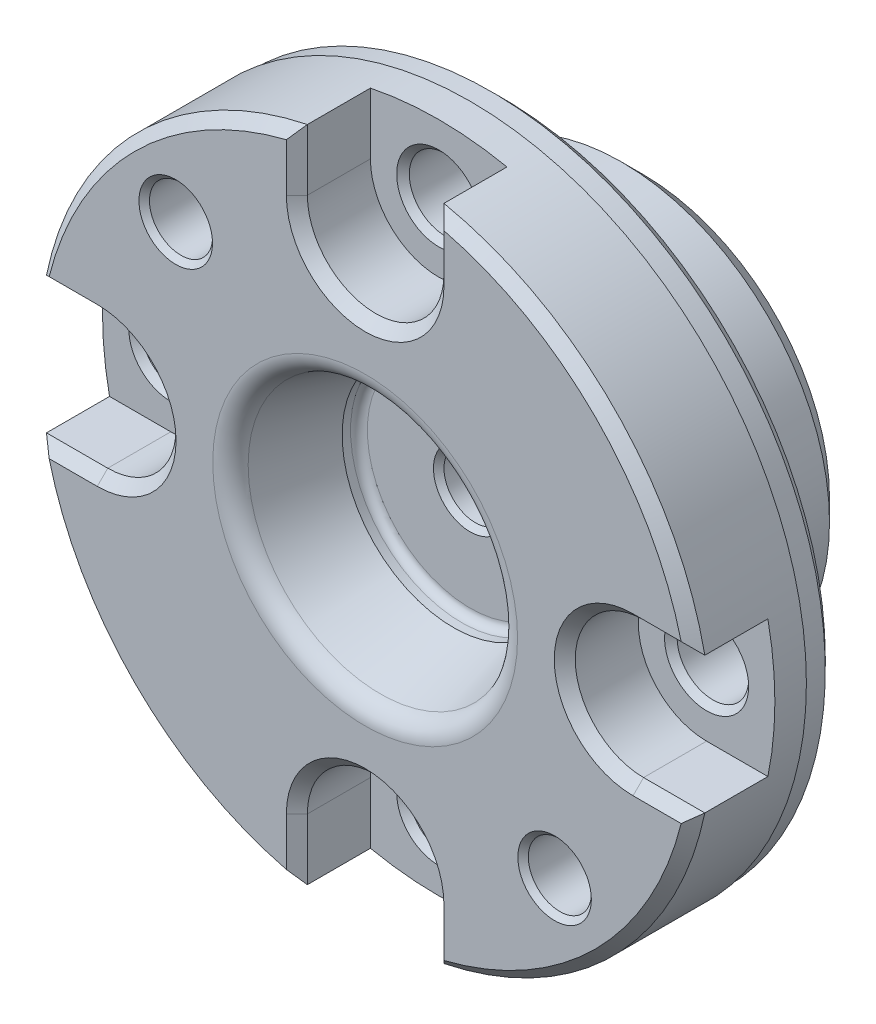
ISO-10303-21;
HEADER;
FILE_DESCRIPTION(('STEP AP214'),'2;1');
FILE_NAME('part.step','',(''),(''),'','','');
FILE_SCHEMA(('AUTOMOTIVE_DESIGN { 1 0 10303 214 1 1 1 1 }'));
ENDSEC;
DATA;
#1=APPLICATION_CONTEXT('core data for automotive mechanical design processes');
#2=APPLICATION_PROTOCOL_DEFINITION('international standard','automotive_design',2000,#1);
#3=PRODUCT_CONTEXT('',#1,'mechanical');
#4=PRODUCT('Part','Part','',(#3));
#5=PRODUCT_RELATED_PRODUCT_CATEGORY('part','',(#4));
#6=PRODUCT_DEFINITION_FORMATION('','',#4);
#7=PRODUCT_DEFINITION_CONTEXT('part definition',#1,'design');
#8=PRODUCT_DEFINITION('design','',#6,#7);
#9=PRODUCT_DEFINITION_SHAPE('','',#8);
#10=(LENGTH_UNIT() NAMED_UNIT(*) SI_UNIT(.MILLI.,.METRE.));
#11=(NAMED_UNIT(*) PLANE_ANGLE_UNIT() SI_UNIT($,.RADIAN.));
#12=(NAMED_UNIT(*) SI_UNIT($,.STERADIAN.) SOLID_ANGLE_UNIT());
#13=UNCERTAINTY_MEASURE_WITH_UNIT(LENGTH_MEASURE(1.E-05),#10,'distance_accuracy_value','');
#14=(GEOMETRIC_REPRESENTATION_CONTEXT(3) GLOBAL_UNCERTAINTY_ASSIGNED_CONTEXT((#13)) GLOBAL_UNIT_ASSIGNED_CONTEXT((#10,
#11,#12)) REPRESENTATION_CONTEXT('',''));
#15=CARTESIAN_POINT('',(0.,0.,0.));
#16=DIRECTION('',(0.,0.,1.));
#17=DIRECTION('',(1.,0.,0.));
#18=AXIS2_PLACEMENT_3D('',#15,#16,#17);
#19=CARTESIAN_POINT('',(-2.17780862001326,-3.05032323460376,-7.3));
#20=DIRECTION('',(0.,0.,1.));
#21=DIRECTION('',(0.,-1.,0.));
#22=AXIS2_PLACEMENT_3D('',#19,#20,#21);
#23=CYLINDRICAL_SURFACE('',#22,0.8);
#24=DIRECTION('',(0.,0.,1.));
#25=VECTOR('',#24,1.);
#26=CARTESIAN_POINT('',(-1.39942788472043,-2.86559794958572,-6.77517602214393));
#27=LINE('',#26,#25);
#28=CARTESIAN_POINT('',(-1.39942788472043,-2.86559794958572,-6.85035204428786));
#29=VERTEX_POINT('',#28);
#30=CARTESIAN_POINT('',(-1.39942788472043,-2.86559794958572,-6.7));
#31=VERTEX_POINT('',#30);
#32=EDGE_CURVE('E31',#29,#31,#27,.T.);
#33=ORIENTED_EDGE('',*,*,#32,.F.);
#34=CARTESIAN_POINT('',(-2.17780862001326,-3.05032323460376,-6.85035204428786));
#35=DIRECTION('',(0.,0.,1.));
#36=DIRECTION('',(1.,0.,0.));
#37=AXIS2_PLACEMENT_3D('',#34,#35,#36);
#38=CIRCLE('',#37,0.8);
#39=CARTESIAN_POINT('',(-1.73950751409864,-2.38107579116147,-6.85035204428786));
#40=VERTEX_POINT('',#39);
#41=EDGE_CURVE('E325',#40,#29,#38,.F.);
#42=ORIENTED_EDGE('',*,*,#41,.F.);
#43=DIRECTION('',(0.,0.,1.));
#44=VECTOR('',#43,1.);
#45=CARTESIAN_POINT('',(-1.73950751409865,-2.38107579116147,-7.3));
#46=LINE('',#45,#44);
#47=CARTESIAN_POINT('',(-1.73950751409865,-2.38107579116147,-7.3));
#48=VERTEX_POINT('',#47);
#49=EDGE_CURVE('E741',#48,#40,#46,.T.);
#50=ORIENTED_EDGE('',*,*,#49,.F.);
#51=CARTESIAN_POINT('',(-2.17780862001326,-3.05032323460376,-7.3));
#52=DIRECTION('',(0.,0.,1.));
#53=DIRECTION('',(0.,-1.,0.));
#54=AXIS2_PLACEMENT_3D('',#51,#52,#53);
#55=CIRCLE('',#54,0.8);
#56=CARTESIAN_POINT('',(-1.48890431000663,-3.45703056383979,-7.3));
#57=VERTEX_POINT('',#56);
#58=EDGE_CURVE('E787',#48,#57,#55,.F.);
#59=ORIENTED_EDGE('',*,*,#58,.T.);
#60=DIRECTION('',(0.,0.,1.));
#61=VECTOR('',#60,1.);
#62=CARTESIAN_POINT('',(-1.48890431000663,-3.45703056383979,-7.3));
#63=LINE('',#62,#61);
#64=CARTESIAN_POINT('',(-1.48890431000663,-3.45703056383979,-6.7));
#65=VERTEX_POINT('',#64);
#66=EDGE_CURVE('E737',#65,#57,#63,.F.);
#67=ORIENTED_EDGE('',*,*,#66,.F.);
#68=CARTESIAN_POINT('',(-2.17780862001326,-3.05032323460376,-6.7));
#69=DIRECTION('',(0.,0.,1.));
#70=DIRECTION('',(0.,-1.,0.));
#71=AXIS2_PLACEMENT_3D('',#68,#69,#70);
#72=CIRCLE('',#71,0.8);
#73=EDGE_CURVE('E808',#31,#65,#72,.F.);
#74=ORIENTED_EDGE('',*,*,#73,.F.);
#75=EDGE_LOOP('',(#33,#42,#50,#59,#67,#74));
#76=FACE_BOUND('',#75,.T.);
#77=ADVANCED_FACE('F14',(#76),#23,.F.);
#78=CARTESIAN_POINT('',(0.,0.275000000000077,-7.3));
#79=DIRECTION('',(0.,0.,1.));
#80=DIRECTION('',(0.,-1.,0.));
#81=AXIS2_PLACEMENT_3D('',#78,#79,#80);
#82=CYLINDRICAL_SURFACE('',#81,3.175);
#83=CARTESIAN_POINT('',(0.,0.275000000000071,-6.7));
#84=DIRECTION('',(0.,0.,1.));
#85=DIRECTION('',(0.,-1.,0.));
#86=AXIS2_PLACEMENT_3D('',#83,#84,#85);
#87=CIRCLE('',#86,3.175);
#88=CARTESIAN_POINT('',(-3.17490085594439,0.300090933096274,-6.7));
#89=VERTEX_POINT('',#88);
#90=CARTESIAN_POINT('',(3.17490085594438,0.300090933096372,-6.7));
#91=VERTEX_POINT('',#90);
#92=EDGE_CURVE('E318',#89,#91,#87,.F.);
#93=ORIENTED_EDGE('',*,*,#92,.T.);
#94=DIRECTION('',(0.,0.,1.));
#95=VECTOR('',#94,1.);
#96=CARTESIAN_POINT('',(3.17490085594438,0.300090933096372,-6.77517602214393));
#97=LINE('',#96,#95);
#98=CARTESIAN_POINT('',(3.17490085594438,0.300090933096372,-6.85035204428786));
#99=VERTEX_POINT('',#98);
#100=EDGE_CURVE('E39',#91,#99,#97,.F.);
#101=ORIENTED_EDGE('',*,*,#100,.T.);
#102=CARTESIAN_POINT('',(0.,0.275000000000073,-6.85035204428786));
#103=DIRECTION('',(0.,0.,1.));
#104=DIRECTION('',(1.,0.,0.));
#105=AXIS2_PLACEMENT_3D('',#102,#103,#104);
#106=CIRCLE('',#105,3.175);
#107=CARTESIAN_POINT('',(1.73950751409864,-2.38107579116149,-6.85035204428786));
#108=VERTEX_POINT('',#107);
#109=EDGE_CURVE('E298',#99,#108,#106,.F.);
#110=ORIENTED_EDGE('',*,*,#109,.T.);
#111=DIRECTION('',(0.,0.,1.));
#112=VECTOR('',#111,1.);
#113=CARTESIAN_POINT('',(1.73950751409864,-2.38107579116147,-7.3));
#114=LINE('',#113,#112);
#115=CARTESIAN_POINT('',(1.73950751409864,-2.38107579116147,-7.3));
#116=VERTEX_POINT('',#115);
#117=EDGE_CURVE('E744',#108,#116,#114,.F.);
#118=ORIENTED_EDGE('',*,*,#117,.T.);
#119=CARTESIAN_POINT('',(0.,0.275000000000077,-7.3));
#120=DIRECTION('',(0.,0.,1.));
#121=DIRECTION('',(0.,-1.,0.));
#122=AXIS2_PLACEMENT_3D('',#119,#120,#121);
#123=CIRCLE('',#122,3.175);
#124=EDGE_CURVE('E790',#116,#48,#123,.T.);
#125=ORIENTED_EDGE('',*,*,#124,.T.);
#126=ORIENTED_EDGE('',*,*,#49,.T.);
#127=CARTESIAN_POINT('',(-3.17490085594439,0.300090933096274,-6.85035204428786));
#128=VERTEX_POINT('',#127);
#129=EDGE_CURVE('E306',#40,#128,#106,.F.);
#130=ORIENTED_EDGE('',*,*,#129,.T.);
#131=DIRECTION('',(0.,0.,1.));
#132=VECTOR('',#131,1.);
#133=CARTESIAN_POINT('',(-3.17490085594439,0.300090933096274,-6.77517602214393));
#134=LINE('',#133,#132);
#135=EDGE_CURVE('E881',#128,#89,#134,.T.);
#136=ORIENTED_EDGE('',*,*,#135,.T.);
#137=EDGE_LOOP('',(#93,#101,#110,#118,#125,#126,#130,#136));
#138=FACE_BOUND('',#137,.T.);
#139=ADVANCED_FACE('F315',(#138),#82,.T.);
#140=CARTESIAN_POINT('',(0.,-3.14999999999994,-7.3));
#141=DIRECTION('',(0.,1.,0.));
#142=DIRECTION('',(0.,0.,1.));
#143=AXIS2_PLACEMENT_3D('',#140,#141,#142);
#144=PLANE('',#143);
#145=DIRECTION('',(0.,0.,1.));
#146=VECTOR('',#145,1.);
#147=CARTESIAN_POINT('',(-0.497543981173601,-3.15000000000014,12.2208926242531));
#148=LINE('',#147,#146);
#149=CARTESIAN_POINT('',(-0.49754398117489,-3.14999999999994,-6.7));
#150=VERTEX_POINT('',#149);
#151=CARTESIAN_POINT('',(-0.497543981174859,-3.14999999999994,-6.85035204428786));
#152=VERTEX_POINT('',#151);
#153=EDGE_CURVE('E877',#150,#152,#148,.F.);
#154=ORIENTED_EDGE('',*,*,#153,.F.);
#155=DIRECTION('',(1.,0.,0.));
#156=VECTOR('',#155,1.);
#157=CARTESIAN_POINT('',(0.,-3.14999999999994,-6.7));
#158=LINE('',#157,#156);
#159=CARTESIAN_POINT('',(-0.800014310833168,-3.15000000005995,-6.7));
#160=VERTEX_POINT('',#159);
#161=EDGE_CURVE('E776',#160,#150,#158,.T.);
#162=ORIENTED_EDGE('',*,*,#161,.F.);
#163=DIRECTION('',(0.,0.,1.));
#164=VECTOR('',#163,1.);
#165=CARTESIAN_POINT('',(-0.800017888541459,-3.15000000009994,-7.3));
#166=LINE('',#165,#164);
#167=CARTESIAN_POINT('',(-0.800014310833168,-3.15000000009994,-7.3));
#168=VERTEX_POINT('',#167);
#169=EDGE_CURVE('E765',#168,#160,#166,.T.);
#170=ORIENTED_EDGE('',*,*,#169,.F.);
#171=DIRECTION('',(1.,0.,0.));
#172=VECTOR('',#171,1.);
#173=CARTESIAN_POINT('',(0.,-3.15000000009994,-7.3));
#174=LINE('',#173,#172);
#175=CARTESIAN_POINT('',(0.800003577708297,-3.15000000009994,-7.3));
#176=VERTEX_POINT('',#175);
#177=EDGE_CURVE('E727',#168,#176,#174,.T.);
#178=ORIENTED_EDGE('',*,*,#177,.T.);
#179=DIRECTION('',(0.,0.,1.));
#180=VECTOR('',#179,1.);
#181=CARTESIAN_POINT('',(0.8,-3.15000000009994,-7.3));
#182=LINE('',#181,#180);
#183=CARTESIAN_POINT('',(0.800003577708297,-3.15000000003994,-6.7));
#184=VERTEX_POINT('',#183);
#185=EDGE_CURVE('E762',#176,#184,#182,.T.);
#186=ORIENTED_EDGE('',*,*,#185,.T.);
#187=CARTESIAN_POINT('',(0.49754398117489,-3.14999999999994,-6.7));
#188=VERTEX_POINT('',#187);
#189=EDGE_CURVE('E780',#188,#184,#158,.T.);
#190=ORIENTED_EDGE('',*,*,#189,.F.);
#191=DIRECTION('',(0.,0.,1.));
#192=VECTOR('',#191,1.);
#193=CARTESIAN_POINT('',(0.497543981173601,-3.15000000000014,12.2208926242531));
#194=LINE('',#193,#192);
#195=CARTESIAN_POINT('',(0.497543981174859,-3.14999999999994,-6.85035204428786));
#196=VERTEX_POINT('',#195);
#197=EDGE_CURVE('E875',#196,#188,#194,.T.);
#198=ORIENTED_EDGE('',*,*,#197,.F.);
#199=DIRECTION('',(1.,0.,0.));
#200=VECTOR('',#199,1.);
#201=CARTESIAN_POINT('',(0.,-3.14999999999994,-6.85035204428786));
#202=LINE('',#201,#200);
#203=EDGE_CURVE('E304',#152,#196,#202,.T.);
#204=ORIENTED_EDGE('',*,*,#203,.F.);
#205=EDGE_LOOP('',(#154,#162,#170,#178,#186,#190,#198,#204));
#206=FACE_BOUND('',#205,.T.);
#207=ADVANCED_FACE('F915',(#206),#144,.F.);
#208=CARTESIAN_POINT('',(2.17780862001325,-3.05032323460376,-7.3));
#209=DIRECTION('',(0.,0.,1.));
#210=DIRECTION('',(0.,-1.,0.));
#211=AXIS2_PLACEMENT_3D('',#208,#209,#210);
#212=CYLINDRICAL_SURFACE('',#211,0.8);
#213=DIRECTION('',(0.,0.,1.));
#214=VECTOR('',#213,1.);
#215=CARTESIAN_POINT('',(1.39942788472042,-2.86559794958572,-6.77517602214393));
#216=LINE('',#215,#214);
#217=CARTESIAN_POINT('',(1.39942788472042,-2.86559794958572,-6.7));
#218=VERTEX_POINT('',#217);
#219=CARTESIAN_POINT('',(1.39942788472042,-2.86559794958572,-6.85035204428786));
#220=VERTEX_POINT('',#219);
#221=EDGE_CURVE('E309',#218,#220,#216,.F.);
#222=ORIENTED_EDGE('',*,*,#221,.F.);
#223=CARTESIAN_POINT('',(2.17780862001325,-3.05032323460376,-6.7));
#224=DIRECTION('',(0.,0.,1.));
#225=DIRECTION('',(0.,-1.,0.));
#226=AXIS2_PLACEMENT_3D('',#223,#224,#225);
#227=CIRCLE('',#226,0.8);
#228=CARTESIAN_POINT('',(1.48890431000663,-3.45703056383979,-6.7));
#229=VERTEX_POINT('',#228);
#230=EDGE_CURVE('E811',#229,#218,#227,.F.);
#231=ORIENTED_EDGE('',*,*,#230,.F.);
#232=DIRECTION('',(0.,0.,1.));
#233=VECTOR('',#232,1.);
#234=CARTESIAN_POINT('',(1.48890431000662,-3.45703056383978,-7.3));
#235=LINE('',#234,#233);
#236=CARTESIAN_POINT('',(1.48890431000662,-3.45703056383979,-7.3));
#237=VERTEX_POINT('',#236);
#238=EDGE_CURVE('E746',#237,#229,#235,.T.);
#239=ORIENTED_EDGE('',*,*,#238,.F.);
#240=CARTESIAN_POINT('',(2.17780862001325,-3.05032323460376,-7.3));
#241=DIRECTION('',(0.,0.,1.));
#242=DIRECTION('',(0.,-1.,0.));
#243=AXIS2_PLACEMENT_3D('',#240,#241,#242);
#244=CIRCLE('',#243,0.8);
#245=EDGE_CURVE('E792',#237,#116,#244,.F.);
#246=ORIENTED_EDGE('',*,*,#245,.T.);
#247=ORIENTED_EDGE('',*,*,#117,.F.);
#248=CARTESIAN_POINT('',(2.17780862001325,-3.05032323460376,-6.85035204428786));
#249=DIRECTION('',(0.,0.,1.));
#250=DIRECTION('',(1.,0.,0.));
#251=AXIS2_PLACEMENT_3D('',#248,#249,#250);
#252=CIRCLE('',#251,0.8);
#253=EDGE_CURVE('E9',#220,#108,#252,.F.);
#254=ORIENTED_EDGE('',*,*,#253,.F.);
#255=EDGE_LOOP('',(#222,#231,#239,#246,#247,#254));
#256=FACE_BOUND('',#255,.T.);
#257=ADVANCED_FACE('F886',(#256),#212,.F.);
#258=CARTESIAN_POINT('',(-9.9,0.,-6.7));
#259=DIRECTION('',(0.,0.,-1.));
#260=DIRECTION('',(-1.,0.,0.));
#261=AXIS2_PLACEMENT_3D('',#258,#259,#260);
#262=PLANE('',#261);
#263=CARTESIAN_POINT('',(0.,0.,-6.7));
#264=DIRECTION('',(0.,0.,-1.));
#265=DIRECTION('',(-1.,0.,0.));
#266=AXIS2_PLACEMENT_3D('',#263,#264,#265);
#267=CIRCLE('',#266,8.9);
#268=CARTESIAN_POINT('',(-8.9,0.,-6.7));
#269=VERTEX_POINT('',#268);
#270=EDGE_CURVE('E570',#269,#269,#267,.T.);
#271=ORIENTED_EDGE('',*,*,#270,.T.);
#272=EDGE_LOOP('',(#271));
#273=FACE_BOUND('',#272,.T.);
#274=ORIENTED_EDGE('',*,*,#230,.T.);
#275=CARTESIAN_POINT('',(0.,0.,-6.7));
#276=DIRECTION('',(0.,0.,-1.));
#277=DIRECTION('',(-1.,0.,0.));
#278=AXIS2_PLACEMENT_3D('',#275,#276,#277);
#279=CIRCLE('',#278,3.18905158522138);
#280=EDGE_CURVE('E320',#218,#91,#279,.F.);
#281=ORIENTED_EDGE('',*,*,#280,.T.);
#282=ORIENTED_EDGE('',*,*,#92,.F.);
#283=EDGE_CURVE('E879',#89,#31,#279,.F.);
#284=ORIENTED_EDGE('',*,*,#283,.T.);
#285=ORIENTED_EDGE('',*,*,#73,.T.);
#286=CARTESIAN_POINT('',(-0.8,-3.86373789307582,-6.7));
#287=DIRECTION('',(0.,0.,1.));
#288=DIRECTION('',(0.,-1.,0.));
#289=AXIS2_PLACEMENT_3D('',#286,#287,#288);
#290=CIRCLE('',#289,0.8);
#291=CARTESIAN_POINT('',(-0.962202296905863,-4.64712184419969,-6.7));
#292=VERTEX_POINT('',#291);
#293=EDGE_CURVE('E23',#292,#65,#290,.F.);
#294=ORIENTED_EDGE('',*,*,#293,.F.);
#295=CARTESIAN_POINT('',(0.,0.,-6.7));
#296=DIRECTION('',(0.,0.,1.));
#297=DIRECTION('',(0.,-1.,0.));
#298=AXIS2_PLACEMENT_3D('',#295,#296,#297);
#299=CIRCLE('',#298,4.74569011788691);
#300=CARTESIAN_POINT('',(-0.200000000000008,-4.74147389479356,-6.7));
#301=VERTEX_POINT('',#300);
#302=EDGE_CURVE('E768',#301,#292,#299,.F.);
#303=ORIENTED_EDGE('',*,*,#302,.F.);
#304=DIRECTION('',(0.,-1.,0.));
#305=VECTOR('',#304,1.);
#306=CARTESIAN_POINT('',(-0.2,-3.54999999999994,-6.7));
#307=LINE('',#306,#305);
#308=CARTESIAN_POINT('',(-0.2,-4.74999999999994,-6.7));
#309=VERTEX_POINT('',#308);
#310=EDGE_CURVE('E766',#301,#309,#307,.T.);
#311=ORIENTED_EDGE('',*,*,#310,.T.);
#312=DIRECTION('',(1.,0.,0.));
#313=VECTOR('',#312,1.);
#314=CARTESIAN_POINT('',(0.,-4.74999999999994,-6.7));
#315=LINE('',#314,#313);
#316=CARTESIAN_POINT('',(0.2,-4.74999999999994,-6.7));
#317=VERTEX_POINT('',#316);
#318=EDGE_CURVE('E769',#309,#317,#315,.T.);
#319=ORIENTED_EDGE('',*,*,#318,.T.);
#320=DIRECTION('',(0.,1.,0.));
#321=VECTOR('',#320,1.);
#322=CARTESIAN_POINT('',(0.2,-3.54999999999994,-6.7));
#323=LINE('',#322,#321);
#324=CARTESIAN_POINT('',(0.2,-4.74147389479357,-6.7));
#325=VERTEX_POINT('',#324);
#326=EDGE_CURVE('E770',#317,#325,#323,.T.);
#327=ORIENTED_EDGE('',*,*,#326,.T.);
#328=CARTESIAN_POINT('',(0.,0.,-6.7));
#329=DIRECTION('',(0.,0.,1.));
#330=DIRECTION('',(0.,-1.,0.));
#331=AXIS2_PLACEMENT_3D('',#328,#329,#330);
#332=CIRCLE('',#331,4.74569011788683);
#333=CARTESIAN_POINT('',(0.962202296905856,-4.6471218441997,-6.7));
#334=VERTEX_POINT('',#333);
#335=EDGE_CURVE('E772',#334,#325,#332,.F.);
#336=ORIENTED_EDGE('',*,*,#335,.F.);
#337=CARTESIAN_POINT('',(0.8,-3.86373789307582,-6.7));
#338=DIRECTION('',(0.,0.,1.));
#339=DIRECTION('',(0.,-1.,0.));
#340=AXIS2_PLACEMENT_3D('',#337,#338,#339);
#341=CIRCLE('',#340,0.8);
#342=EDGE_CURVE('E814',#229,#334,#341,.F.);
#343=ORIENTED_EDGE('',*,*,#342,.F.);
#344=EDGE_LOOP('',(#274,#281,#282,#284,#285,#294,#303,#311,#319,#327,#336,#343));
#345=FACE_BOUND('',#344,.T.);
#346=ADVANCED_FACE('F883',(#273,#345),#262,.T.);
#347=ORIENTED_EDGE('',*,*,#161,.T.);
#348=CARTESIAN_POINT('',(0.,0.,-6.7));
#349=DIRECTION('',(0.,0.,-1.));
#350=DIRECTION('',(-1.,0.,0.));
#351=AXIS2_PLACEMENT_3D('',#348,#349,#350);
#352=CIRCLE('',#351,3.18905158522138);
#353=EDGE_CURVE('E872',#150,#188,#352,.F.);
#354=ORIENTED_EDGE('',*,*,#353,.T.);
#355=ORIENTED_EDGE('',*,*,#189,.T.);
#356=CARTESIAN_POINT('',(0.800008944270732,-3.54999999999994,-6.7));
#357=DIRECTION('',(0.,0.,1.));
#358=DIRECTION('',(0.,-1.,0.));
#359=AXIS2_PLACEMENT_3D('',#356,#357,#358);
#360=CIRCLE('',#359,0.4);
#361=CARTESIAN_POINT('',(0.800003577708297,-3.94999999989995,-6.7));
#362=VERTEX_POINT('',#361);
#363=EDGE_CURVE('E775',#184,#362,#360,.F.);
#364=ORIENTED_EDGE('',*,*,#363,.T.);
#365=DIRECTION('',(1.,0.,0.));
#366=VECTOR('',#365,1.);
#367=CARTESIAN_POINT('',(0.8,-3.94999999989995,-6.7));
#368=LINE('',#367,#366);
#369=CARTESIAN_POINT('',(-0.800003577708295,-3.94999999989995,-6.7));
#370=VERTEX_POINT('',#369);
#371=EDGE_CURVE('E717',#362,#370,#368,.F.);
#372=ORIENTED_EDGE('',*,*,#371,.T.);
#373=CARTESIAN_POINT('',(-0.800008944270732,-3.54999999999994,-6.7));
#374=DIRECTION('',(0.,0.,1.));
#375=DIRECTION('',(0.,-1.,0.));
#376=AXIS2_PLACEMENT_3D('',#373,#374,#375);
#377=CIRCLE('',#376,0.4);
#378=EDGE_CURVE('E779',#370,#160,#377,.F.);
#379=ORIENTED_EDGE('',*,*,#378,.T.);
#380=EDGE_LOOP('',(#347,#354,#355,#364,#372,#379));
#381=FACE_BOUND('',#380,.T.);
#382=ADVANCED_FACE('F918',(#381),#262,.T.);
#383=CARTESIAN_POINT('',(0.,0.,5.5));
#384=DIRECTION('',(0.,0.,1.));
#385=DIRECTION('',(1.,0.,0.));
#386=AXIS2_PLACEMENT_3D('',#383,#384,#385);
#387=TOROIDAL_SURFACE('',#386,7.25355405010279,1.);
#388=CARTESIAN_POINT('',(0.,0.,6.5));
#389=DIRECTION('',(0.,0.,1.));
#390=DIRECTION('',(1.,0.,0.));
#391=AXIS2_PLACEMENT_3D('',#388,#389,#390);
#392=CIRCLE('',#391,7.25355405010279);
#393=CARTESIAN_POINT('',(7.25355405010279,0.,6.5));
#394=VERTEX_POINT('',#393);
#395=EDGE_CURVE('E846',#394,#394,#392,.F.);
#396=ORIENTED_EDGE('',*,*,#395,.F.);
#397=EDGE_LOOP('',(#396));
#398=FACE_BOUND('',#397,.T.);
#399=CARTESIAN_POINT('',(0.,0.,5.775637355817));
#400=DIRECTION('',(0.,0.,-1.));
#401=DIRECTION('',(-1.,0.,0.));
#402=AXIS2_PLACEMENT_3D('',#399,#400,#401);
#403=CIRCLE('',#402,6.29229235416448);
#404=CARTESIAN_POINT('',(-6.29229235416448,0.,5.775637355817));
#405=VERTEX_POINT('',#404);
#406=EDGE_CURVE('E843',#405,#405,#403,.F.);
#407=ORIENTED_EDGE('',*,*,#406,.F.);
#408=EDGE_LOOP('',(#407));
#409=FACE_BOUND('',#408,.T.);
#410=ADVANCED_FACE('F934',(#398,#409),#387,.T.);
#411=CARTESIAN_POINT('',(0.,0.,2.3));
#412=DIRECTION('',(0.,0.,1.));
#413=DIRECTION('',(1.,0.,0.));
#414=AXIS2_PLACEMENT_3D('',#411,#412,#413);
#415=CONICAL_SURFACE('',#414,5.295669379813,0.279252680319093);
#416=ORIENTED_EDGE('',*,*,#406,.T.);
#417=EDGE_LOOP('',(#416));
#418=FACE_BOUND('',#417,.T.);
#419=CARTESIAN_POINT('',(0.,0.,2.3));
#420=DIRECTION('',(0.,0.,1.));
#421=DIRECTION('',(1.,0.,0.));
#422=AXIS2_PLACEMENT_3D('',#419,#420,#421);
#423=CIRCLE('',#422,5.295669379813);
#424=CARTESIAN_POINT('',(5.295669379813,0.,2.3));
#425=VERTEX_POINT('',#424);
#426=EDGE_CURVE('E834',#425,#425,#423,.T.);
#427=ORIENTED_EDGE('',*,*,#426,.F.);
#428=EDGE_LOOP('',(#427));
#429=FACE_BOUND('',#428,.T.);
#430=ADVANCED_FACE('F948',(#418,#429),#415,.F.);
#431=CARTESIAN_POINT('',(0.,0.,6.5));
#432=DIRECTION('',(0.,0.,1.));
#433=DIRECTION('',(1.,0.,0.));
#434=AXIS2_PLACEMENT_3D('',#431,#432,#433);
#435=CYLINDRICAL_SURFACE('',#434,5.295669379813);
#436=CARTESIAN_POINT('',(0.,0.,1.9));
#437=DIRECTION('',(0.,0.,1.));
#438=DIRECTION('',(1.,0.,0.));
#439=AXIS2_PLACEMENT_3D('',#436,#437,#438);
#440=CIRCLE('',#439,5.295669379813);
#441=CARTESIAN_POINT('',(5.295669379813,0.,1.9));
#442=VERTEX_POINT('',#441);
#443=EDGE_CURVE('E840',#442,#442,#440,.F.);
#444=ORIENTED_EDGE('',*,*,#443,.T.);
#445=EDGE_LOOP('',(#444));
#446=FACE_BOUND('',#445,.T.);
#447=ORIENTED_EDGE('',*,*,#426,.T.);
#448=EDGE_LOOP('',(#447));
#449=FACE_BOUND('',#448,.T.);
#450=ADVANCED_FACE('F1036',(#446,#449),#435,.F.);
#451=CARTESIAN_POINT('',(0.,0.,1.9));
#452=DIRECTION('',(0.,0.,1.));
#453=DIRECTION('',(1.,0.,0.));
#454=AXIS2_PLACEMENT_3D('',#451,#452,#453);
#455=TOROIDAL_SURFACE('',#454,4.895669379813,0.4);
#456=ORIENTED_EDGE('',*,*,#443,.F.);
#457=EDGE_LOOP('',(#456));
#458=FACE_BOUND('',#457,.T.);
#459=CARTESIAN_POINT('',(0.,0.,1.5));
#460=DIRECTION('',(0.,0.,1.));
#461=DIRECTION('',(1.,0.,0.));
#462=AXIS2_PLACEMENT_3D('',#459,#460,#461);
#463=CIRCLE('',#462,4.895669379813);
#464=CARTESIAN_POINT('',(4.895669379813,0.,1.5));
#465=VERTEX_POINT('',#464);
#466=EDGE_CURVE('E837',#465,#465,#463,.T.);
#467=ORIENTED_EDGE('',*,*,#466,.F.);
#468=EDGE_LOOP('',(#467));
#469=FACE_BOUND('',#468,.T.);
#470=ADVANCED_FACE('F1027',(#458,#469),#455,.F.);
#471=CARTESIAN_POINT('',(5.295669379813,0.,1.5));
#472=DIRECTION('',(0.,0.,1.));
#473=DIRECTION('',(1.,0.,0.));
#474=AXIS2_PLACEMENT_3D('',#471,#472,#473);
#475=PLANE('',#474);
#476=ORIENTED_EDGE('',*,*,#466,.T.);
#477=EDGE_LOOP('',(#476));
#478=FACE_BOUND('',#477,.T.);
#479=CARTESIAN_POINT('',(0.,0.,1.5));
#480=DIRECTION('',(0.,0.,1.));
#481=DIRECTION('',(1.,0.,0.));
#482=AXIS2_PLACEMENT_3D('',#479,#480,#481);
#483=CIRCLE('',#482,1.75);
#484=CARTESIAN_POINT('',(1.75,0.,1.5));
#485=VERTEX_POINT('',#484);
#486=EDGE_CURVE('E327',#485,#485,#483,.T.);
#487=ORIENTED_EDGE('',*,*,#486,.F.);
#488=EDGE_LOOP('',(#487));
#489=FACE_BOUND('',#488,.T.);
#490=ADVANCED_FACE('F1023',(#478,#489),#475,.T.);
#491=CARTESIAN_POINT('',(0.8,-3.94999999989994,-7.3));
#492=DIRECTION('',(0.,-1.,0.));
#493=DIRECTION('',(0.,0.,-1.));
#494=AXIS2_PLACEMENT_3D('',#491,#492,#493);
#495=PLANE('',#494);
#496=DIRECTION('',(0.,0.,-1.));
#497=VECTOR('',#496,1.);
#498=CARTESIAN_POINT('',(0.8,-3.94999999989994,-7.3));
#499=LINE('',#498,#497);
#500=CARTESIAN_POINT('',(0.800003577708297,-3.94999999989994,-7.3));
#501=VERTEX_POINT('',#500);
#502=EDGE_CURVE('E761',#362,#501,#499,.T.);
#503=ORIENTED_EDGE('',*,*,#502,.T.);
#504=DIRECTION('',(1.,0.,0.));
#505=VECTOR('',#504,1.);
#506=CARTESIAN_POINT('',(0.,-3.94999999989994,-7.3));
#507=LINE('',#506,#505);
#508=CARTESIAN_POINT('',(-0.800003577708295,-3.94999999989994,-7.3));
#509=VERTEX_POINT('',#508);
#510=EDGE_CURVE('E731',#501,#509,#507,.F.);
#511=ORIENTED_EDGE('',*,*,#510,.T.);
#512=DIRECTION('',(0.,0.,-1.));
#513=VECTOR('',#512,1.);
#514=CARTESIAN_POINT('',(-0.8,-3.94999999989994,-7.3));
#515=LINE('',#514,#513);
#516=EDGE_CURVE('E824',#509,#370,#515,.F.);
#517=ORIENTED_EDGE('',*,*,#516,.T.);
#518=ORIENTED_EDGE('',*,*,#371,.F.);
#519=EDGE_LOOP('',(#503,#511,#517,#518));
#520=FACE_BOUND('',#519,.T.);
#521=ADVANCED_FACE('F925',(#520),#495,.F.);
#522=CARTESIAN_POINT('',(0.800008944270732,-3.54999999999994,-7.3));
#523=DIRECTION('',(0.,0.,1.));
#524=DIRECTION('',(0.,-1.,0.));
#525=AXIS2_PLACEMENT_3D('',#522,#523,#524);
#526=CYLINDRICAL_SURFACE('',#525,0.4);
#527=ORIENTED_EDGE('',*,*,#363,.F.);
#528=ORIENTED_EDGE('',*,*,#185,.F.);
#529=CARTESIAN_POINT('',(0.800008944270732,-3.54999999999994,-7.3));
#530=DIRECTION('',(0.,0.,1.));
#531=DIRECTION('',(0.,-1.,0.));
#532=AXIS2_PLACEMENT_3D('',#529,#530,#531);
#533=CIRCLE('',#532,0.4);
#534=EDGE_CURVE('E726',#176,#501,#533,.F.);
#535=ORIENTED_EDGE('',*,*,#534,.T.);
#536=ORIENTED_EDGE('',*,*,#502,.F.);
#537=EDGE_LOOP('',(#527,#528,#535,#536));
#538=FACE_BOUND('',#537,.T.);
#539=ADVANCED_FACE('F922',(#538),#526,.F.);
#540=CARTESIAN_POINT('',(0.,-0.841080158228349,-7.3));
#541=DIRECTION('',(0.,0.,1.));
#542=DIRECTION('',(0.,-1.,0.));
#543=AXIS2_PLACEMENT_3D('',#540,#541,#542);
#544=PLANE('',#543);
#545=CARTESIAN_POINT('',(0.,0.,-7.3));
#546=DIRECTION('',(0.,0.,1.));
#547=DIRECTION('',(0.,-1.,0.));
#548=AXIS2_PLACEMENT_3D('',#545,#546,#547);
#549=CIRCLE('',#548,2.5);
#550=CARTESIAN_POINT('',(0.,-2.5,-7.30000000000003));
#551=VERTEX_POINT('',#550);
#552=EDGE_CURVE('E574',#551,#551,#549,.T.);
#553=ORIENTED_EDGE('',*,*,#552,.T.);
#554=EDGE_LOOP('',(#553));
#555=FACE_BOUND('',#554,.T.);
#556=CARTESIAN_POINT('',(-0.8,-3.86373789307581,-7.3));
#557=DIRECTION('',(0.,0.,1.));
#558=DIRECTION('',(0.,-1.,0.));
#559=AXIS2_PLACEMENT_3D('',#556,#557,#558);
#560=CIRCLE('',#559,0.8);
#561=CARTESIAN_POINT('',(-0.962202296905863,-4.64712184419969,-7.3));
#562=VERTEX_POINT('',#561);
#563=EDGE_CURVE('E784',#57,#562,#560,.T.);
#564=ORIENTED_EDGE('',*,*,#563,.F.);
#565=ORIENTED_EDGE('',*,*,#58,.F.);
#566=ORIENTED_EDGE('',*,*,#124,.F.);
#567=ORIENTED_EDGE('',*,*,#245,.F.);
#568=CARTESIAN_POINT('',(0.8,-3.86373789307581,-7.3));
#569=DIRECTION('',(0.,0.,1.));
#570=DIRECTION('',(0.,-1.,0.));
#571=AXIS2_PLACEMENT_3D('',#568,#569,#570);
#572=CIRCLE('',#571,0.8);
#573=CARTESIAN_POINT('',(0.962202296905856,-4.64712184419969,-7.3));
#574=VERTEX_POINT('',#573);
#575=EDGE_CURVE('E795',#574,#237,#572,.T.);
#576=ORIENTED_EDGE('',*,*,#575,.F.);
#577=CARTESIAN_POINT('',(0.,0.,-7.3));
#578=DIRECTION('',(0.,0.,1.));
#579=DIRECTION('',(0.,-1.,0.));
#580=AXIS2_PLACEMENT_3D('',#577,#578,#579);
#581=CIRCLE('',#580,4.74569011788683);
#582=CARTESIAN_POINT('',(0.2,-4.74147389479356,-7.3));
#583=VERTEX_POINT('',#582);
#584=EDGE_CURVE('E721',#583,#574,#581,.T.);
#585=ORIENTED_EDGE('',*,*,#584,.F.);
#586=DIRECTION('',(0.,-1.,0.));
#587=VECTOR('',#586,1.);
#588=CARTESIAN_POINT('',(0.2,-0.841080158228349,-7.3));
#589=LINE('',#588,#587);
#590=CARTESIAN_POINT('',(0.2,-4.74999999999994,-7.3));
#591=VERTEX_POINT('',#590);
#592=EDGE_CURVE('E718',#591,#583,#589,.F.);
#593=ORIENTED_EDGE('',*,*,#592,.F.);
#594=DIRECTION('',(1.,0.,0.));
#595=VECTOR('',#594,1.);
#596=CARTESIAN_POINT('',(0.,-4.74999999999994,-7.3));
#597=LINE('',#596,#595);
#598=CARTESIAN_POINT('',(-0.200000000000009,-4.74999999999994,-7.3));
#599=VERTEX_POINT('',#598);
#600=EDGE_CURVE('E722',#599,#591,#597,.T.);
#601=ORIENTED_EDGE('',*,*,#600,.F.);
#602=DIRECTION('',(0.,-1.,0.));
#603=VECTOR('',#602,1.);
#604=CARTESIAN_POINT('',(-0.200000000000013,-0.841080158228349,-7.3));
#605=LINE('',#604,#603);
#606=CARTESIAN_POINT('',(-0.200000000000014,-4.74147389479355,-7.3));
#607=VERTEX_POINT('',#606);
#608=EDGE_CURVE('E723',#607,#599,#605,.T.);
#609=ORIENTED_EDGE('',*,*,#608,.F.);
#610=CARTESIAN_POINT('',(0.,0.,-7.3));
#611=DIRECTION('',(0.,0.,1.));
#612=DIRECTION('',(0.,-1.,0.));
#613=AXIS2_PLACEMENT_3D('',#610,#611,#612);
#614=CIRCLE('',#613,4.74569011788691);
#615=EDGE_CURVE('E781',#562,#607,#614,.T.);
#616=ORIENTED_EDGE('',*,*,#615,.F.);
#617=EDGE_LOOP('',(#564,#565,#566,#567,#576,#585,#593,#601,#609,#616));
#618=FACE_BOUND('',#617,.T.);
#619=ORIENTED_EDGE('',*,*,#177,.F.);
#620=CARTESIAN_POINT('',(-0.800008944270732,-3.54999999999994,-7.3));
#621=DIRECTION('',(0.,0.,1.));
#622=DIRECTION('',(0.,-1.,0.));
#623=AXIS2_PLACEMENT_3D('',#620,#621,#622);
#624=CIRCLE('',#623,0.4);
#625=EDGE_CURVE('E730',#509,#168,#624,.F.);
#626=ORIENTED_EDGE('',*,*,#625,.F.);
#627=ORIENTED_EDGE('',*,*,#510,.F.);
#628=ORIENTED_EDGE('',*,*,#534,.F.);
#629=EDGE_LOOP('',(#619,#626,#627,#628));
#630=FACE_BOUND('',#629,.T.);
#631=ADVANCED_FACE('F893',(#555,#618,#630),#544,.F.);
#632=CARTESIAN_POINT('',(-0.800008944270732,-3.54999999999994,-7.3));
#633=DIRECTION('',(0.,0.,1.));
#634=DIRECTION('',(0.,-1.,0.));
#635=AXIS2_PLACEMENT_3D('',#632,#633,#634);
#636=CYLINDRICAL_SURFACE('',#635,0.4);
#637=ORIENTED_EDGE('',*,*,#378,.F.);
#638=ORIENTED_EDGE('',*,*,#516,.F.);
#639=ORIENTED_EDGE('',*,*,#625,.T.);
#640=ORIENTED_EDGE('',*,*,#169,.T.);
#641=EDGE_LOOP('',(#637,#638,#639,#640));
#642=FACE_BOUND('',#641,.T.);
#643=ADVANCED_FACE('F928',(#642),#636,.F.);
#644=CARTESIAN_POINT('',(-0.8,-3.86373789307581,-7.3));
#645=DIRECTION('',(0.,0.,1.));
#646=DIRECTION('',(0.,-1.,0.));
#647=AXIS2_PLACEMENT_3D('',#644,#645,#646);
#648=CYLINDRICAL_SURFACE('',#647,0.8);
#649=ORIENTED_EDGE('',*,*,#563,.T.);
#650=DIRECTION('',(0.,0.,1.));
#651=VECTOR('',#650,1.);
#652=CARTESIAN_POINT('',(-0.962202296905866,-4.64712184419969,-7.3));
#653=LINE('',#652,#651);
#654=EDGE_CURVE('E735',#292,#562,#653,.F.);
#655=ORIENTED_EDGE('',*,*,#654,.F.);
#656=ORIENTED_EDGE('',*,*,#293,.T.);
#657=ORIENTED_EDGE('',*,*,#66,.T.);
#658=EDGE_LOOP('',(#649,#655,#656,#657));
#659=FACE_BOUND('',#658,.T.);
#660=ADVANCED_FACE('F935',(#659),#648,.T.);
#661=CARTESIAN_POINT('',(0.8,-3.86373789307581,-7.3));
#662=DIRECTION('',(0.,0.,1.));
#663=DIRECTION('',(0.,-1.,0.));
#664=AXIS2_PLACEMENT_3D('',#661,#662,#663);
#665=CYLINDRICAL_SURFACE('',#664,0.8);
#666=ORIENTED_EDGE('',*,*,#575,.T.);
#667=ORIENTED_EDGE('',*,*,#238,.T.);
#668=ORIENTED_EDGE('',*,*,#342,.T.);
#669=DIRECTION('',(0.,0.,1.));
#670=VECTOR('',#669,1.);
#671=CARTESIAN_POINT('',(0.962202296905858,-4.64712184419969,-7.3));
#672=LINE('',#671,#670);
#673=EDGE_CURVE('E749',#334,#574,#672,.F.);
#674=ORIENTED_EDGE('',*,*,#673,.T.);
#675=EDGE_LOOP('',(#666,#667,#668,#674));
#676=FACE_BOUND('',#675,.T.);
#677=ADVANCED_FACE('F951',(#676),#665,.T.);
#678=CARTESIAN_POINT('',(0.,0.,-7.3));
#679=DIRECTION('',(0.,0.,1.));
#680=DIRECTION('',(0.,-1.,0.));
#681=AXIS2_PLACEMENT_3D('',#678,#679,#680);
#682=CYLINDRICAL_SURFACE('',#681,4.74569011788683);
#683=ORIENTED_EDGE('',*,*,#584,.T.);
#684=ORIENTED_EDGE('',*,*,#673,.F.);
#685=ORIENTED_EDGE('',*,*,#335,.T.);
#686=DIRECTION('',(0.,0.,1.));
#687=VECTOR('',#686,1.);
#688=CARTESIAN_POINT('',(0.2,-4.74147389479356,-7.3));
#689=LINE('',#688,#687);
#690=EDGE_CURVE('E751',#325,#583,#689,.F.);
#691=ORIENTED_EDGE('',*,*,#690,.T.);
#692=EDGE_LOOP('',(#683,#684,#685,#691));
#693=FACE_BOUND('',#692,.T.);
#694=ADVANCED_FACE('F1695',(#693),#682,.T.);
#695=CARTESIAN_POINT('',(0.2,-3.54999999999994,-7.));
#696=DIRECTION('',(-1.,0.,0.));
#697=DIRECTION('',(0.,1.,0.));
#698=AXIS2_PLACEMENT_3D('',#695,#696,#697);
#699=PLANE('',#698);
#700=ORIENTED_EDGE('',*,*,#326,.F.);
#701=DIRECTION('',(0.,0.,-1.));
#702=VECTOR('',#701,1.);
#703=CARTESIAN_POINT('',(0.2,-4.74999999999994,-7.));
#704=LINE('',#703,#702);
#705=EDGE_CURVE('E753',#591,#317,#704,.F.);
#706=ORIENTED_EDGE('',*,*,#705,.F.);
#707=ORIENTED_EDGE('',*,*,#592,.T.);
#708=ORIENTED_EDGE('',*,*,#690,.F.);
#709=EDGE_LOOP('',(#700,#706,#707,#708));
#710=FACE_BOUND('',#709,.T.);
#711=ADVANCED_FACE('F1691',(#710),#699,.F.);
#712=CARTESIAN_POINT('',(0.,-4.74999999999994,-7.));
#713=DIRECTION('',(0.,1.,0.));
#714=DIRECTION('',(1.,0.,0.));
#715=AXIS2_PLACEMENT_3D('',#712,#713,#714);
#716=PLANE('',#715);
#717=ORIENTED_EDGE('',*,*,#318,.F.);
#718=DIRECTION('',(0.,0.,-1.));
#719=VECTOR('',#718,1.);
#720=CARTESIAN_POINT('',(-0.2,-4.74999999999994,-7.));
#721=LINE('',#720,#719);
#722=EDGE_CURVE('E756',#599,#309,#721,.F.);
#723=ORIENTED_EDGE('',*,*,#722,.F.);
#724=ORIENTED_EDGE('',*,*,#600,.T.);
#725=ORIENTED_EDGE('',*,*,#705,.T.);
#726=EDGE_LOOP('',(#717,#723,#724,#725));
#727=FACE_BOUND('',#726,.T.);
#728=ADVANCED_FACE('F974',(#727),#716,.F.);
#729=CARTESIAN_POINT('',(-0.2,-3.54999999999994,-7.));
#730=DIRECTION('',(1.,0.,0.));
#731=DIRECTION('',(0.,-1.,0.));
#732=AXIS2_PLACEMENT_3D('',#729,#730,#731);
#733=PLANE('',#732);
#734=ORIENTED_EDGE('',*,*,#608,.T.);
#735=ORIENTED_EDGE('',*,*,#722,.T.);
#736=ORIENTED_EDGE('',*,*,#310,.F.);
#737=DIRECTION('',(0.,0.,1.));
#738=VECTOR('',#737,1.);
#739=CARTESIAN_POINT('',(-0.200000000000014,-4.74147389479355,-7.3));
#740=LINE('',#739,#738);
#741=EDGE_CURVE('E734',#607,#301,#740,.T.);
#742=ORIENTED_EDGE('',*,*,#741,.F.);
#743=EDGE_LOOP('',(#734,#735,#736,#742));
#744=FACE_BOUND('',#743,.T.);
#745=ADVANCED_FACE('F964',(#744),#733,.F.);
#746=CARTESIAN_POINT('',(0.,0.,-7.3));
#747=DIRECTION('',(0.,0.,1.));
#748=DIRECTION('',(0.,-1.,0.));
#749=AXIS2_PLACEMENT_3D('',#746,#747,#748);
#750=CYLINDRICAL_SURFACE('',#749,4.74569011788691);
#751=ORIENTED_EDGE('',*,*,#615,.T.);
#752=ORIENTED_EDGE('',*,*,#741,.T.);
#753=ORIENTED_EDGE('',*,*,#302,.T.);
#754=ORIENTED_EDGE('',*,*,#654,.T.);
#755=EDGE_LOOP('',(#751,#752,#753,#754));
#756=FACE_BOUND('',#755,.T.);
#757=ADVANCED_FACE('F943',(#756),#750,.T.);
#758=CARTESIAN_POINT('',(0.,0.,6.5));
#759=DIRECTION('',(0.,0.,1.));
#760=DIRECTION('',(1.,0.,0.));
#761=AXIS2_PLACEMENT_3D('',#758,#759,#760);
#762=CYLINDRICAL_SURFACE('',#761,2.5);
#763=CARTESIAN_POINT('',(0.,0.,-7.7));
#764=DIRECTION('',(0.,0.,-1.));
#765=DIRECTION('',(-1.,0.,0.));
#766=AXIS2_PLACEMENT_3D('',#763,#764,#765);
#767=CIRCLE('',#766,2.5);
#768=CARTESIAN_POINT('',(-2.5,0.,-7.7));
#769=VERTEX_POINT('',#768);
#770=EDGE_CURVE('E849',#769,#769,#767,.F.);
#771=ORIENTED_EDGE('',*,*,#770,.T.);
#772=EDGE_LOOP('',(#771));
#773=FACE_BOUND('',#772,.T.);
#774=ORIENTED_EDGE('',*,*,#552,.F.);
#775=EDGE_LOOP('',(#774));
#776=FACE_BOUND('',#775,.T.);
#777=ADVANCED_FACE('F963',(#773,#776),#762,.T.);
#778=CARTESIAN_POINT('',(0.,0.,-7.7));
#779=DIRECTION('',(0.,0.,1.));
#780=DIRECTION('',(1.,0.,0.));
#781=AXIS2_PLACEMENT_3D('',#778,#779,#780);
#782=CONICAL_SURFACE('',#781,2.5,0.785398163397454);
#783=CARTESIAN_POINT('',(0.,0.,-8.));
#784=DIRECTION('',(0.,0.,-1.));
#785=DIRECTION('',(-1.,0.,0.));
#786=AXIS2_PLACEMENT_3D('',#783,#784,#785);
#787=CIRCLE('',#786,2.2);
#788=CARTESIAN_POINT('',(-2.2,0.,-8.));
#789=VERTEX_POINT('',#788);
#790=EDGE_CURVE('E829',#789,#789,#787,.T.);
#791=ORIENTED_EDGE('',*,*,#790,.F.);
#792=EDGE_LOOP('',(#791));
#793=FACE_BOUND('',#792,.T.);
#794=ORIENTED_EDGE('',*,*,#770,.F.);
#795=EDGE_LOOP('',(#794));
#796=FACE_BOUND('',#795,.T.);
#797=ADVANCED_FACE('F16',(#793,#796),#782,.T.);
#798=CARTESIAN_POINT('',(2.5,0.,-8.));
#799=DIRECTION('',(0.,0.,-1.));
#800=DIRECTION('',(-1.,0.,0.));
#801=AXIS2_PLACEMENT_3D('',#798,#799,#800);
#802=PLANE('',#801);
#803=CARTESIAN_POINT('',(0.,0.,-8.));
#804=DIRECTION('',(0.,0.,-1.));
#805=DIRECTION('',(-1.,0.,0.));
#806=AXIS2_PLACEMENT_3D('',#803,#804,#805);
#807=CIRCLE('',#806,1.5);
#808=CARTESIAN_POINT('',(-1.5,0.,-8.));
#809=VERTEX_POINT('',#808);
#810=EDGE_CURVE('E859',#809,#809,#807,.T.);
#811=ORIENTED_EDGE('',*,*,#810,.F.);
#812=EDGE_LOOP('',(#811));
#813=FACE_BOUND('',#812,.T.);
#814=ORIENTED_EDGE('',*,*,#790,.T.);
#815=EDGE_LOOP('',(#814));
#816=FACE_BOUND('',#815,.T.);
#817=ADVANCED_FACE('F1022',(#813,#816),#802,.T.);
#818=CARTESIAN_POINT('',(0.,0.,1.5));
#819=DIRECTION('',(0.,0.,1.));
#820=DIRECTION('',(1.,0.,0.));
#821=AXIS2_PLACEMENT_3D('',#818,#819,#820);
#822=CONICAL_SURFACE('',#821,1.75,0.785398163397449);
#823=CARTESIAN_POINT('',(0.,0.,1.25));
#824=DIRECTION('',(0.,0.,1.));
#825=DIRECTION('',(1.,0.,0.));
#826=AXIS2_PLACEMENT_3D('',#823,#824,#825);
#827=CIRCLE('',#826,1.5);
#828=CARTESIAN_POINT('',(1.5,0.,1.25));
#829=VERTEX_POINT('',#828);
#830=EDGE_CURVE('E18',#829,#829,#827,.F.);
#831=ORIENTED_EDGE('',*,*,#830,.T.);
#832=EDGE_LOOP('',(#831));
#833=FACE_BOUND('',#832,.T.);
#834=ORIENTED_EDGE('',*,*,#486,.T.);
#835=EDGE_LOOP('',(#834));
#836=FACE_BOUND('',#835,.T.);
#837=ADVANCED_FACE('F1019',(#833,#836),#822,.F.);
#838=CARTESIAN_POINT('',(0.,0.,-6.7));
#839=DIRECTION('',(0.,0.,1.));
#840=DIRECTION('',(1.,0.,0.));
#841=AXIS2_PLACEMENT_3D('',#838,#839,#840);
#842=CONICAL_SURFACE('',#841,8.9,0.785398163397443);
#843=CARTESIAN_POINT('',(0.,0.,-5.7));
#844=DIRECTION('',(0.,0.,-1.));
#845=DIRECTION('',(-1.,0.,0.));
#846=AXIS2_PLACEMENT_3D('',#843,#844,#845);
#847=CIRCLE('',#846,9.9);
#848=CARTESIAN_POINT('',(-9.9,0.,-5.7));
#849=VERTEX_POINT('',#848);
#850=EDGE_CURVE('E714',#849,#849,#847,.F.);
#851=ORIENTED_EDGE('',*,*,#850,.F.);
#852=EDGE_LOOP('',(#851));
#853=FACE_BOUND('',#852,.T.);
#854=ORIENTED_EDGE('',*,*,#270,.F.);
#855=EDGE_LOOP('',(#854));
#856=FACE_BOUND('',#855,.T.);
#857=ADVANCED_FACE('F993',(#853,#856),#842,.T.);
#858=CARTESIAN_POINT('',(0.,0.,0.));
#859=DIRECTION('',(0.,0.,-1.));
#860=DIRECTION('',(-1.,0.,0.));
#861=AXIS2_PLACEMENT_3D('',#858,#859,#860);
#862=CYLINDRICAL_SURFACE('',#861,9.9);
#863=ORIENTED_EDGE('',*,*,#850,.T.);
#864=EDGE_LOOP('',(#863));
#865=FACE_BOUND('',#864,.T.);
#866=CARTESIAN_POINT('',(0.,0.,-1.));
#867=DIRECTION('',(0.,0.,-1.));
#868=DIRECTION('',(-1.,0.,0.));
#869=AXIS2_PLACEMENT_3D('',#866,#867,#868);
#870=CIRCLE('',#869,9.9);
#871=CARTESIAN_POINT('',(-9.9,0.,-1.));
#872=VERTEX_POINT('',#871);
#873=EDGE_CURVE('E335',#872,#872,#870,.T.);
#874=ORIENTED_EDGE('',*,*,#873,.T.);
#875=EDGE_LOOP('',(#874));
#876=FACE_BOUND('',#875,.T.);
#877=ADVANCED_FACE('F1740',(#865,#876),#862,.T.);
#878=CARTESIAN_POINT('',(0.,0.,-0.48038475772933));
#879=DIRECTION('',(0.,0.,-1.));
#880=DIRECTION('',(-1.,0.,0.));
#881=AXIS2_PLACEMENT_3D('',#878,#879,#880);
#882=CONICAL_SURFACE('',#881,9.6,0.523598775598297);
#883=ORIENTED_EDGE('',*,*,#873,.F.);
#884=EDGE_LOOP('',(#883));
#885=FACE_BOUND('',#884,.T.);
#886=CARTESIAN_POINT('',(0.,0.,-0.48038475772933));
#887=DIRECTION('',(0.,0.,-1.));
#888=DIRECTION('',(-1.,0.,0.));
#889=AXIS2_PLACEMENT_3D('',#886,#887,#888);
#890=CIRCLE('',#889,9.6);
#891=CARTESIAN_POINT('',(-9.6,0.,-0.48038475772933));
#892=VERTEX_POINT('',#891);
#893=EDGE_CURVE('E338',#892,#892,#890,.T.);
#894=ORIENTED_EDGE('',*,*,#893,.T.);
#895=EDGE_LOOP('',(#894));
#896=FACE_BOUND('',#895,.T.);
#897=ADVANCED_FACE('F1749',(#885,#896),#882,.T.);
#898=CARTESIAN_POINT('',(0.,0.,0.));
#899=DIRECTION('',(0.,0.,-1.));
#900=DIRECTION('',(-1.,0.,0.));
#901=AXIS2_PLACEMENT_3D('',#898,#899,#900);
#902=CYLINDRICAL_SURFACE('',#901,9.6);
#903=ORIENTED_EDGE('',*,*,#893,.F.);
#904=EDGE_LOOP('',(#903));
#905=FACE_BOUND('',#904,.T.);
#906=CARTESIAN_POINT('',(0.,0.,-0.1));
#907=DIRECTION('',(0.,0.,-1.));
#908=DIRECTION('',(-1.,0.,0.));
#909=AXIS2_PLACEMENT_3D('',#906,#907,#908);
#910=CIRCLE('',#909,9.6);
#911=CARTESIAN_POINT('',(-9.6,0.,-0.1));
#912=VERTEX_POINT('',#911);
#913=EDGE_CURVE('E341',#912,#912,#910,.T.);
#914=ORIENTED_EDGE('',*,*,#913,.T.);
#915=EDGE_LOOP('',(#914));
#916=FACE_BOUND('',#915,.T.);
#917=ADVANCED_FACE('F1759',(#905,#916),#902,.T.);
#918=CARTESIAN_POINT('',(0.,0.,-0.1));
#919=DIRECTION('',(0.,0.,-1.));
#920=DIRECTION('',(-1.,0.,0.));
#921=AXIS2_PLACEMENT_3D('',#918,#919,#920);
#922=TOROIDAL_SURFACE('',#921,10.,0.4);
#923=ORIENTED_EDGE('',*,*,#913,.F.);
#924=EDGE_LOOP('',(#923));
#925=FACE_BOUND('',#924,.T.);
#926=CARTESIAN_POINT('',(0.,0.,0.144510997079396));
#927=DIRECTION('',(0.,0.,-1.));
#928=DIRECTION('',(-1.,0.,0.));
#929=AXIS2_PLACEMENT_3D('',#926,#927,#928);
#930=CIRCLE('',#929,10.3165665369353);
#931=CARTESIAN_POINT('',(-10.3165665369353,0.,0.144510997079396));
#932=VERTEX_POINT('',#931);
#933=EDGE_CURVE('E344',#932,#932,#930,.T.);
#934=ORIENTED_EDGE('',*,*,#933,.T.);
#935=EDGE_LOOP('',(#934));
#936=FACE_BOUND('',#935,.T.);
#937=ADVANCED_FACE('F1769',(#925,#936),#922,.F.);
#938=CARTESIAN_POINT('',(-16.,0.,6.5));
#939=DIRECTION('',(0.,0.,1.));
#940=DIRECTION('',(1.,0.,0.));
#941=AXIS2_PLACEMENT_3D('',#938,#939,#940);
#942=PLANE('',#941);
#943=DIRECTION('',(0.,-1.,0.));
#944=VECTOR('',#943,1.);
#945=CARTESIAN_POINT('',(3.75000000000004,-15.6664450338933,6.5));
#946=LINE('',#945,#944);
#947=CARTESIAN_POINT('',(3.75,-12.75,6.5));
#948=VERTEX_POINT('',#947);
#949=CARTESIAN_POINT('',(3.75,-15.0395312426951,6.5));
#950=VERTEX_POINT('',#949);
#951=EDGE_CURVE('E536',#948,#950,#946,.T.);
#952=ORIENTED_EDGE('',*,*,#951,.T.);
#953=CARTESIAN_POINT('',(0.,0.,6.5));
#954=DIRECTION('',(0.,0.,1.));
#955=DIRECTION('',(1.,0.,0.));
#956=AXIS2_PLACEMENT_3D('',#953,#954,#955);
#957=CIRCLE('',#956,15.5);
#958=CARTESIAN_POINT('',(15.0395312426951,-3.74999999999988,6.5));
#959=VERTEX_POINT('',#958);
#960=EDGE_CURVE('E538',#950,#959,#957,.T.);
#961=ORIENTED_EDGE('',*,*,#960,.T.);
#962=DIRECTION('',(-1.,0.,0.));
#963=VECTOR('',#962,1.);
#964=CARTESIAN_POINT('',(12.75,-3.7499999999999,6.5));
#965=LINE('',#964,#963);
#966=CARTESIAN_POINT('',(12.75,-3.7499999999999,6.5));
#967=VERTEX_POINT('',#966);
#968=EDGE_CURVE('E532',#959,#967,#965,.T.);
#969=ORIENTED_EDGE('',*,*,#968,.T.);
#970=CARTESIAN_POINT('',(12.75,0.,6.5));
#971=DIRECTION('',(0.,0.,1.));
#972=DIRECTION('',(1.,0.,0.));
#973=AXIS2_PLACEMENT_3D('',#970,#971,#972);
#974=CIRCLE('',#973,3.75);
#975=CARTESIAN_POINT('',(12.75,3.75000000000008,6.5));
#976=VERTEX_POINT('',#975);
#977=EDGE_CURVE('E530',#967,#976,#974,.F.);
#978=ORIENTED_EDGE('',*,*,#977,.T.);
#979=DIRECTION('',(1.,0.,0.));
#980=VECTOR('',#979,1.);
#981=CARTESIAN_POINT('',(15.6664450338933,3.7500000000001,6.5));
#982=LINE('',#981,#980);
#983=CARTESIAN_POINT('',(15.039531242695,3.7500000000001,6.5));
#984=VERTEX_POINT('',#983);
#985=EDGE_CURVE('E526',#976,#984,#982,.T.);
#986=ORIENTED_EDGE('',*,*,#985,.T.);
#987=CARTESIAN_POINT('',(0.,0.,6.5));
#988=DIRECTION('',(0.,0.,1.));
#989=DIRECTION('',(1.,0.,0.));
#990=AXIS2_PLACEMENT_3D('',#987,#988,#989);
#991=CIRCLE('',#990,15.5);
#992=CARTESIAN_POINT('',(3.74999999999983,15.0395312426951,6.5));
#993=VERTEX_POINT('',#992);
#994=EDGE_CURVE('E522',#984,#993,#991,.T.);
#995=ORIENTED_EDGE('',*,*,#994,.T.);
#996=DIRECTION('',(0.,-1.,0.));
#997=VECTOR('',#996,1.);
#998=CARTESIAN_POINT('',(3.74999999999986,12.75,6.5));
#999=LINE('',#998,#997);
#1000=CARTESIAN_POINT('',(3.74999999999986,12.75,6.5));
#1001=VERTEX_POINT('',#1000);
#1002=EDGE_CURVE('E515',#993,#1001,#999,.T.);
#1003=ORIENTED_EDGE('',*,*,#1002,.T.);
#1004=CARTESIAN_POINT('',(-1.35110663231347E-13,12.75,6.5));
#1005=DIRECTION('',(0.,0.,1.));
#1006=DIRECTION('',(1.,0.,0.));
#1007=AXIS2_PLACEMENT_3D('',#1004,#1005,#1006);
#1008=CIRCLE('',#1007,3.75);
#1009=CARTESIAN_POINT('',(-3.75000000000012,12.75,6.5));
#1010=VERTEX_POINT('',#1009);
#1011=EDGE_CURVE('E513',#1001,#1010,#1008,.F.);
#1012=ORIENTED_EDGE('',*,*,#1011,.T.);
#1013=DIRECTION('',(0.,1.,0.));
#1014=VECTOR('',#1013,1.);
#1015=CARTESIAN_POINT('',(-3.75000000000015,15.6664450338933,6.5));
#1016=LINE('',#1015,#1014);
#1017=CARTESIAN_POINT('',(-3.75000000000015,15.039531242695,6.5));
#1018=VERTEX_POINT('',#1017);
#1019=EDGE_CURVE('E509',#1010,#1018,#1016,.T.);
#1020=ORIENTED_EDGE('',*,*,#1019,.T.);
#1021=CARTESIAN_POINT('',(0.,0.,6.5));
#1022=DIRECTION('',(0.,0.,1.));
#1023=DIRECTION('',(1.,0.,0.));
#1024=AXIS2_PLACEMENT_3D('',#1021,#1022,#1023);
#1025=CIRCLE('',#1024,15.5);
#1026=CARTESIAN_POINT('',(-15.0395312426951,3.75,6.5));
#1027=VERTEX_POINT('',#1026);
#1028=EDGE_CURVE('E507',#1018,#1027,#1025,.T.);
#1029=ORIENTED_EDGE('',*,*,#1028,.T.);
#1030=DIRECTION('',(1.,0.,0.));
#1031=VECTOR('',#1030,1.);
#1032=CARTESIAN_POINT('',(-12.75,3.75,6.5));
#1033=LINE('',#1032,#1031);
#1034=CARTESIAN_POINT('',(-12.75,3.75,6.5));
#1035=VERTEX_POINT('',#1034);
#1036=EDGE_CURVE('E511',#1027,#1035,#1033,.T.);
#1037=ORIENTED_EDGE('',*,*,#1036,.T.);
#1038=CARTESIAN_POINT('',(-12.75,0.,6.5));
#1039=DIRECTION('',(0.,0.,1.));
#1040=DIRECTION('',(1.,0.,0.));
#1041=AXIS2_PLACEMENT_3D('',#1038,#1039,#1040);
#1042=CIRCLE('',#1041,3.75);
#1043=CARTESIAN_POINT('',(-12.75,-3.75,6.5));
#1044=VERTEX_POINT('',#1043);
#1045=EDGE_CURVE('E517',#1035,#1044,#1042,.F.);
#1046=ORIENTED_EDGE('',*,*,#1045,.T.);
#1047=DIRECTION('',(-1.,0.,0.));
#1048=VECTOR('',#1047,1.);
#1049=CARTESIAN_POINT('',(-15.6664450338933,-3.75,6.5));
#1050=LINE('',#1049,#1048);
#1051=CARTESIAN_POINT('',(-15.0395312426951,-3.75,6.5));
#1052=VERTEX_POINT('',#1051);
#1053=EDGE_CURVE('E519',#1044,#1052,#1050,.T.);
#1054=ORIENTED_EDGE('',*,*,#1053,.T.);
#1055=CARTESIAN_POINT('',(0.,0.,6.5));
#1056=DIRECTION('',(0.,0.,1.));
#1057=DIRECTION('',(1.,0.,0.));
#1058=AXIS2_PLACEMENT_3D('',#1055,#1056,#1057);
#1059=CIRCLE('',#1058,15.5);
#1060=CARTESIAN_POINT('',(-3.74999999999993,-15.0395312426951,6.5));
#1061=VERTEX_POINT('',#1060);
#1062=EDGE_CURVE('E524',#1052,#1061,#1059,.T.);
#1063=ORIENTED_EDGE('',*,*,#1062,.T.);
#1064=DIRECTION('',(0.,1.,0.));
#1065=VECTOR('',#1064,1.);
#1066=CARTESIAN_POINT('',(-3.74999999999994,-12.75,6.5));
#1067=LINE('',#1066,#1065);
#1068=CARTESIAN_POINT('',(-3.74999999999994,-12.75,6.5));
#1069=VERTEX_POINT('',#1068);
#1070=EDGE_CURVE('E528',#1061,#1069,#1067,.T.);
#1071=ORIENTED_EDGE('',*,*,#1070,.T.);
#1072=CARTESIAN_POINT('',(0.,-12.75,6.5));
#1073=DIRECTION('',(0.,0.,1.));
#1074=DIRECTION('',(1.,0.,0.));
#1075=AXIS2_PLACEMENT_3D('',#1072,#1073,#1074);
#1076=CIRCLE('',#1075,3.75);
#1077=EDGE_CURVE('E534',#1069,#948,#1076,.F.);
#1078=ORIENTED_EDGE('',*,*,#1077,.T.);
#1079=EDGE_LOOP('',(#952,#961,#969,#978,#986,#995,#1003,#1012,#1020,#1029,#1037,#1046,#1054,
#1063,#1071,#1078));
#1080=FACE_BOUND('',#1079,.T.);
#1081=CARTESIAN_POINT('',(-9.0156114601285,9.01561146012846,6.5));
#1082=DIRECTION('',(0.,0.,1.));
#1083=DIRECTION('',(1.,0.,0.));
#1084=AXIS2_PLACEMENT_3D('',#1081,#1082,#1083);
#1085=CIRCLE('',#1084,1.75);
#1086=CARTESIAN_POINT('',(-7.2656114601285,9.01561146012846,6.5));
#1087=VERTEX_POINT('',#1086);
#1088=EDGE_CURVE('E350',#1087,#1087,#1085,.T.);
#1089=ORIENTED_EDGE('',*,*,#1088,.F.);
#1090=EDGE_LOOP('',(#1089));
#1091=FACE_BOUND('',#1090,.T.);
#1092=CARTESIAN_POINT('',(9.0156114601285,-9.01561146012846,6.5));
#1093=DIRECTION('',(0.,0.,1.));
#1094=DIRECTION('',(1.,0.,0.));
#1095=AXIS2_PLACEMENT_3D('',#1092,#1093,#1094);
#1096=CIRCLE('',#1095,1.75);
#1097=CARTESIAN_POINT('',(10.7656114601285,-9.01561146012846,6.5));
#1098=VERTEX_POINT('',#1097);
#1099=EDGE_CURVE('E356',#1098,#1098,#1096,.T.);
#1100=ORIENTED_EDGE('',*,*,#1099,.F.);
#1101=EDGE_LOOP('',(#1100));
#1102=FACE_BOUND('',#1101,.T.);
#1103=ORIENTED_EDGE('',*,*,#395,.T.);
#1104=EDGE_LOOP('',(#1103));
#1105=FACE_BOUND('',#1104,.T.);
#1106=ADVANCED_FACE('F662',(#1080,#1091,#1102,#1105),#942,.T.);
#1107=CARTESIAN_POINT('',(3.25000000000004,-12.75,6.));
#1108=DIRECTION('',(-0.707106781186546,0.,0.70710678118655));
#1109=DIRECTION('',(0.70710678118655,0.,0.707106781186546));
#1110=AXIS2_PLACEMENT_3D('',#1107,#1108,#1109);
#1111=PLANE('',#1110);
#1112=CARTESIAN_POINT('',(3.75,-15.0395312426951,6.5));
#1113=CARTESIAN_POINT('',(3.66741539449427,-15.1452112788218,6.41741539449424));
#1114=CARTESIAN_POINT('',(3.58445640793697,-15.2502941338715,6.33445640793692));
#1115=CARTESIAN_POINT('',(3.41778974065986,-15.4592653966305,6.1677897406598));
#1116=CARTESIAN_POINT('',(3.33408206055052,-15.5631538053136,6.08408206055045));
#1117=CARTESIAN_POINT('',(3.25000000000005,-15.6664450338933,6.));
#1118=B_SPLINE_CURVE_WITH_KNOTS('',3,(#1112,#1113,#1114,#1115,#1116,#1117),.UNSPECIFIED.,.F.,
.F.,(4,2,4),(0.,0.47250517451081,0.945009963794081),.UNSPECIFIED.);
#1119=CARTESIAN_POINT('',(3.25000000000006,-15.6664450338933,6.));
#1120=VERTEX_POINT('',#1119);
#1121=EDGE_CURVE('E646',#1120,#950,#1118,.F.);
#1122=ORIENTED_EDGE('',*,*,#1121,.T.);
#1123=ORIENTED_EDGE('',*,*,#951,.F.);
#1124=DIRECTION('',(0.70710678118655,0.,0.707106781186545));
#1125=VECTOR('',#1124,1.);
#1126=CARTESIAN_POINT('',(3.25000000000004,-12.75,6.));
#1127=LINE('',#1126,#1125);
#1128=CARTESIAN_POINT('',(3.25000000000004,-12.75,6.));
#1129=VERTEX_POINT('',#1128);
#1130=EDGE_CURVE('E640',#1129,#948,#1127,.T.);
#1131=ORIENTED_EDGE('',*,*,#1130,.F.);
#1132=DIRECTION('',(0.,1.,0.));
#1133=VECTOR('',#1132,1.);
#1134=CARTESIAN_POINT('',(3.25000000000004,-12.75,6.));
#1135=LINE('',#1134,#1133);
#1136=EDGE_CURVE('E544',#1120,#1129,#1135,.T.);
#1137=ORIENTED_EDGE('',*,*,#1136,.F.);
#1138=EDGE_LOOP('',(#1122,#1123,#1131,#1137));
#1139=FACE_BOUND('',#1138,.T.);
#1140=ADVANCED_FACE('F658',(#1139),#1111,.T.);
#1141=CARTESIAN_POINT('',(0.,0.,6.));
#1142=DIRECTION('',(0.,0.,-1.));
#1143=DIRECTION('',(-1.,0.,0.));
#1144=AXIS2_PLACEMENT_3D('',#1141,#1142,#1143);
#1145=CONICAL_SURFACE('',#1144,16.,0.785398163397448);
#1146=CARTESIAN_POINT('',(15.6664450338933,-3.24999999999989,6.));
#1147=CARTESIAN_POINT('',(15.5631538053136,-3.33408206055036,6.08408206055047));
#1148=CARTESIAN_POINT('',(15.4592653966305,-3.41778974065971,6.16778974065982));
#1149=CARTESIAN_POINT('',(15.2502941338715,-3.58445640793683,6.33445640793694));
#1150=CARTESIAN_POINT('',(15.1452112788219,-3.66741539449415,6.41741539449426));
#1151=CARTESIAN_POINT('',(15.0395312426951,-3.74999999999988,6.5));
#1152=B_SPLINE_CURVE_WITH_KNOTS('',3,(#1146,#1147,#1148,#1149,#1150,#1151),.UNSPECIFIED.,.F.,
.F.,(4,2,4),(0.,0.472504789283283,0.945009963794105),.UNSPECIFIED.);
#1153=CARTESIAN_POINT('',(15.6664450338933,-3.24999999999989,6.));
#1154=VERTEX_POINT('',#1153);
#1155=EDGE_CURVE('E677',#1154,#959,#1152,.T.);
#1156=ORIENTED_EDGE('',*,*,#1155,.T.);
#1157=ORIENTED_EDGE('',*,*,#960,.F.);
#1158=ORIENTED_EDGE('',*,*,#1121,.F.);
#1159=CARTESIAN_POINT('',(0.,0.,6.));
#1160=DIRECTION('',(0.,0.,1.));
#1161=DIRECTION('',(1.,0.,0.));
#1162=AXIS2_PLACEMENT_3D('',#1159,#1160,#1161);
#1163=CIRCLE('',#1162,16.);
#1164=EDGE_CURVE('E566',#1154,#1120,#1163,.F.);
#1165=ORIENTED_EDGE('',*,*,#1164,.F.);
#1166=EDGE_LOOP('',(#1156,#1157,#1158,#1165));
#1167=FACE_BOUND('',#1166,.T.);
#1168=ADVANCED_FACE('F656',(#1167),#1145,.T.);
#1169=CARTESIAN_POINT('',(12.75,-3.24999999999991,6.));
#1170=DIRECTION('',(0.,0.707106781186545,0.70710678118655));
#1171=DIRECTION('',(0.,-0.70710678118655,0.707106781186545));
#1172=AXIS2_PLACEMENT_3D('',#1169,#1170,#1171);
#1173=PLANE('',#1172);
#1174=DIRECTION('',(0.,-0.70710678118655,0.707106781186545));
#1175=VECTOR('',#1174,1.);
#1176=CARTESIAN_POINT('',(12.75,-3.24999999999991,6.));
#1177=LINE('',#1176,#1175);
#1178=CARTESIAN_POINT('',(12.75,-3.24999999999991,6.));
#1179=VERTEX_POINT('',#1178);
#1180=EDGE_CURVE('E691',#1179,#967,#1177,.T.);
#1181=ORIENTED_EDGE('',*,*,#1180,.T.);
#1182=ORIENTED_EDGE('',*,*,#968,.F.);
#1183=ORIENTED_EDGE('',*,*,#1155,.F.);
#1184=DIRECTION('',(1.,0.,0.));
#1185=VECTOR('',#1184,1.);
#1186=CARTESIAN_POINT('',(15.6664450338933,-3.24999999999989,6.));
#1187=LINE('',#1186,#1185);
#1188=EDGE_CURVE('E552',#1179,#1154,#1187,.T.);
#1189=ORIENTED_EDGE('',*,*,#1188,.F.);
#1190=EDGE_LOOP('',(#1181,#1182,#1183,#1189));
#1191=FACE_BOUND('',#1190,.T.);
#1192=ADVANCED_FACE('F668',(#1191),#1173,.T.);
#1193=CARTESIAN_POINT('',(12.75,0.,6.));
#1194=DIRECTION('',(0.,0.,1.));
#1195=DIRECTION('',(1.,0.,0.));
#1196=AXIS2_PLACEMENT_3D('',#1193,#1194,#1195);
#1197=CONICAL_SURFACE('',#1196,3.25,0.785398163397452);
#1198=DIRECTION('',(0.,0.70710678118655,0.707106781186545));
#1199=VECTOR('',#1198,1.);
#1200=CARTESIAN_POINT('',(12.75,3.25000000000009,6.));
#1201=LINE('',#1200,#1199);
#1202=CARTESIAN_POINT('',(12.75,3.25000000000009,6.));
#1203=VERTEX_POINT('',#1202);
#1204=EDGE_CURVE('E332',#1203,#976,#1201,.T.);
#1205=ORIENTED_EDGE('',*,*,#1204,.T.);
#1206=ORIENTED_EDGE('',*,*,#977,.F.);
#1207=ORIENTED_EDGE('',*,*,#1180,.F.);
#1208=CARTESIAN_POINT('',(12.75,0.,6.));
#1209=DIRECTION('',(0.,0.,1.));
#1210=DIRECTION('',(1.,0.,0.));
#1211=AXIS2_PLACEMENT_3D('',#1208,#1209,#1210);
#1212=CIRCLE('',#1211,3.25);
#1213=EDGE_CURVE('E554',#1203,#1179,#1212,.T.);
#1214=ORIENTED_EDGE('',*,*,#1213,.F.);
#1215=EDGE_LOOP('',(#1205,#1206,#1207,#1214));
#1216=FACE_BOUND('',#1215,.T.);
#1217=ADVANCED_FACE('F672',(#1216),#1197,.F.);
#1218=CARTESIAN_POINT('',(12.75,3.25000000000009,6.));
#1219=DIRECTION('',(0.,-0.707106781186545,0.70710678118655));
#1220=DIRECTION('',(0.,-0.70710678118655,-0.707106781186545));
#1221=AXIS2_PLACEMENT_3D('',#1218,#1219,#1220);
#1222=PLANE('',#1221);
#1223=CARTESIAN_POINT('',(15.039531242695,3.7500000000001,6.5));
#1224=CARTESIAN_POINT('',(15.1452112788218,3.66741539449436,6.41741539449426));
#1225=CARTESIAN_POINT('',(15.2502941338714,3.58445640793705,6.33445640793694));
#1226=CARTESIAN_POINT('',(15.4592653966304,3.41778974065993,6.16778974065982));
#1227=CARTESIAN_POINT('',(15.5631538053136,3.33408206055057,6.08408206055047));
#1228=CARTESIAN_POINT('',(15.6664450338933,3.2500000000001,6.));
#1229=B_SPLINE_CURVE_WITH_KNOTS('',3,(#1223,#1224,#1225,#1226,#1227,#1228),.UNSPECIFIED.,.F.,
.F.,(4,2,4),(0.,0.472505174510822,0.945009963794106),.UNSPECIFIED.);
#1230=CARTESIAN_POINT('',(15.6664450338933,3.25000000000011,6.));
#1231=VERTEX_POINT('',#1230);
#1232=EDGE_CURVE('E703',#984,#1231,#1229,.T.);
#1233=ORIENTED_EDGE('',*,*,#1232,.F.);
#1234=ORIENTED_EDGE('',*,*,#985,.F.);
#1235=ORIENTED_EDGE('',*,*,#1204,.F.);
#1236=DIRECTION('',(-1.,0.,0.));
#1237=VECTOR('',#1236,1.);
#1238=CARTESIAN_POINT('',(12.75,3.25000000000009,6.));
#1239=LINE('',#1238,#1237);
#1240=EDGE_CURVE('E550',#1231,#1203,#1239,.T.);
#1241=ORIENTED_EDGE('',*,*,#1240,.F.);
#1242=EDGE_LOOP('',(#1233,#1234,#1235,#1241));
#1243=FACE_BOUND('',#1242,.T.);
#1244=ADVANCED_FACE('F697',(#1243),#1222,.T.);
#1245=CARTESIAN_POINT('',(0.,0.,6.));
#1246=DIRECTION('',(0.,0.,-1.));
#1247=DIRECTION('',(-1.,0.,0.));
#1248=AXIS2_PLACEMENT_3D('',#1245,#1246,#1247);
#1249=CONICAL_SURFACE('',#1248,16.,0.785398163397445);
#1250=ORIENTED_EDGE('',*,*,#1232,.T.);
#1251=CARTESIAN_POINT('',(0.,0.,6.));
#1252=DIRECTION('',(0.,0.,1.));
#1253=DIRECTION('',(1.,0.,0.));
#1254=AXIS2_PLACEMENT_3D('',#1251,#1252,#1253);
#1255=CIRCLE('',#1254,16.);
#1256=CARTESIAN_POINT('',(3.24999999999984,15.6664450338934,6.));
#1257=VERTEX_POINT('',#1256);
#1258=EDGE_CURVE('E564',#1257,#1231,#1255,.F.);
#1259=ORIENTED_EDGE('',*,*,#1258,.F.);
#1260=CARTESIAN_POINT('',(3.24999999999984,15.6664450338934,6.));
#1261=CARTESIAN_POINT('',(3.3340820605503,15.5631538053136,6.08408206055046));
#1262=CARTESIAN_POINT('',(3.41778974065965,15.4592653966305,6.16778974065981));
#1263=CARTESIAN_POINT('',(3.58445640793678,15.2502941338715,6.33445640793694));
#1264=CARTESIAN_POINT('',(3.66741539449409,15.1452112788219,6.41741539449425));
#1265=CARTESIAN_POINT('',(3.74999999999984,15.0395312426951,6.5));
#1266=B_SPLINE_CURVE_WITH_KNOTS('',3,(#1260,#1261,#1262,#1263,#1264,#1265),.UNSPECIFIED.,.F.,
.F.,(4,2,4),(0.,0.472504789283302,0.945009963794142),.UNSPECIFIED.);
#1267=EDGE_CURVE('E684',#993,#1257,#1266,.F.);
#1268=ORIENTED_EDGE('',*,*,#1267,.F.);
#1269=ORIENTED_EDGE('',*,*,#994,.F.);
#1270=EDGE_LOOP('',(#1250,#1259,#1268,#1269));
#1271=FACE_BOUND('',#1270,.T.);
#1272=ADVANCED_FACE('F674',(#1271),#1249,.T.);
#1273=CARTESIAN_POINT('',(3.24999999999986,12.75,6.));
#1274=DIRECTION('',(-0.707106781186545,0.,0.70710678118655));
#1275=DIRECTION('',(0.70710678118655,0.,0.707106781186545));
#1276=AXIS2_PLACEMENT_3D('',#1273,#1274,#1275);
#1277=PLANE('',#1276);
#1278=ORIENTED_EDGE('',*,*,#1267,.T.);
#1279=DIRECTION('',(0.,1.,0.));
#1280=VECTOR('',#1279,1.);
#1281=CARTESIAN_POINT('',(3.24999999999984,15.6664450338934,6.));
#1282=LINE('',#1281,#1280);
#1283=CARTESIAN_POINT('',(3.24999999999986,12.75,6.));
#1284=VERTEX_POINT('',#1283);
#1285=EDGE_CURVE('E558',#1284,#1257,#1282,.T.);
#1286=ORIENTED_EDGE('',*,*,#1285,.F.);
#1287=DIRECTION('',(-0.70710678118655,0.,-0.707106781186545));
#1288=VECTOR('',#1287,1.);
#1289=CARTESIAN_POINT('',(3.74999999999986,12.75,6.5));
#1290=LINE('',#1289,#1288);
#1291=EDGE_CURVE('E654',#1001,#1284,#1290,.T.);
#1292=ORIENTED_EDGE('',*,*,#1291,.F.);
#1293=ORIENTED_EDGE('',*,*,#1002,.F.);
#1294=EDGE_LOOP('',(#1278,#1286,#1292,#1293));
#1295=FACE_BOUND('',#1294,.T.);
#1296=ADVANCED_FACE('F666',(#1295),#1277,.T.);
#1297=CARTESIAN_POINT('',(-1.35110663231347E-13,12.75,6.));
#1298=DIRECTION('',(0.,0.,1.));
#1299=DIRECTION('',(1.,0.,0.));
#1300=AXIS2_PLACEMENT_3D('',#1297,#1298,#1299);
#1301=CONICAL_SURFACE('',#1300,3.25,0.785398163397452);
#1302=ORIENTED_EDGE('',*,*,#1291,.T.);
#1303=CARTESIAN_POINT('',(-1.35110663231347E-13,12.75,6.));
#1304=DIRECTION('',(0.,0.,1.));
#1305=DIRECTION('',(1.,0.,0.));
#1306=AXIS2_PLACEMENT_3D('',#1303,#1304,#1305);
#1307=CIRCLE('',#1306,3.25);
#1308=CARTESIAN_POINT('',(-3.25000000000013,12.75,6.));
#1309=VERTEX_POINT('',#1308);
#1310=EDGE_CURVE('E560',#1309,#1284,#1307,.T.);
#1311=ORIENTED_EDGE('',*,*,#1310,.F.);
#1312=DIRECTION('',(0.70710678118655,0.,-0.707106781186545));
#1313=VECTOR('',#1312,1.);
#1314=CARTESIAN_POINT('',(-3.75000000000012,12.75,6.5));
#1315=LINE('',#1314,#1313);
#1316=EDGE_CURVE('E643',#1010,#1309,#1315,.T.);
#1317=ORIENTED_EDGE('',*,*,#1316,.F.);
#1318=ORIENTED_EDGE('',*,*,#1011,.F.);
#1319=EDGE_LOOP('',(#1302,#1311,#1317,#1318));
#1320=FACE_BOUND('',#1319,.T.);
#1321=ADVANCED_FACE('F630',(#1320),#1301,.F.);
#1322=CARTESIAN_POINT('',(-3.25000000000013,12.75,6.));
#1323=DIRECTION('',(0.707106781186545,0.,0.70710678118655));
#1324=DIRECTION('',(0.70710678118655,0.,-0.707106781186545));
#1325=AXIS2_PLACEMENT_3D('',#1322,#1323,#1324);
#1326=PLANE('',#1325);
#1327=ORIENTED_EDGE('',*,*,#1316,.T.);
#1328=DIRECTION('',(0.,-1.,0.));
#1329=VECTOR('',#1328,1.);
#1330=CARTESIAN_POINT('',(-3.25000000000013,12.75,6.));
#1331=LINE('',#1330,#1329);
#1332=CARTESIAN_POINT('',(-3.25000000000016,15.6664450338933,6.));
#1333=VERTEX_POINT('',#1332);
#1334=EDGE_CURVE('E556',#1333,#1309,#1331,.T.);
#1335=ORIENTED_EDGE('',*,*,#1334,.F.);
#1336=CARTESIAN_POINT('',(-3.75000000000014,15.039531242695,6.5));
#1337=CARTESIAN_POINT('',(-3.66741539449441,15.1452112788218,6.41741539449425));
#1338=CARTESIAN_POINT('',(-3.5844564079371,15.2502941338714,6.33445640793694));
#1339=CARTESIAN_POINT('',(-3.41778974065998,15.4592653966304,6.16778974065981));
#1340=CARTESIAN_POINT('',(-3.33408206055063,15.5631538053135,6.08408206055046));
#1341=CARTESIAN_POINT('',(-3.25000000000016,15.6664450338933,6.));
#1342=B_SPLINE_CURVE_WITH_KNOTS('',3,(#1336,#1337,#1338,#1339,#1340,#1341),.UNSPECIFIED.,.F.,
.F.,(4,2,4),(0.,0.472505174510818,0.9450099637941),.UNSPECIFIED.);
#1343=EDGE_CURVE('E633',#1018,#1333,#1342,.T.);
#1344=ORIENTED_EDGE('',*,*,#1343,.F.);
#1345=ORIENTED_EDGE('',*,*,#1019,.F.);
#1346=EDGE_LOOP('',(#1327,#1335,#1344,#1345));
#1347=FACE_BOUND('',#1346,.T.);
#1348=ADVANCED_FACE('F626',(#1347),#1326,.T.);
#1349=CARTESIAN_POINT('',(0.,0.,6.));
#1350=DIRECTION('',(0.,0.,-1.));
#1351=DIRECTION('',(-1.,0.,0.));
#1352=AXIS2_PLACEMENT_3D('',#1349,#1350,#1351);
#1353=CONICAL_SURFACE('',#1352,16.,0.78539816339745);
#1354=ORIENTED_EDGE('',*,*,#1343,.T.);
#1355=CARTESIAN_POINT('',(0.,0.,6.));
#1356=DIRECTION('',(0.,0.,1.));
#1357=DIRECTION('',(1.,0.,0.));
#1358=AXIS2_PLACEMENT_3D('',#1355,#1356,#1357);
#1359=CIRCLE('',#1358,16.);
#1360=CARTESIAN_POINT('',(-15.6664450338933,3.25,6.));
#1361=VERTEX_POINT('',#1360);
#1362=EDGE_CURVE('E562',#1361,#1333,#1359,.F.);
#1363=ORIENTED_EDGE('',*,*,#1362,.F.);
#1364=CARTESIAN_POINT('',(-15.6664450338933,3.25,6.));
#1365=CARTESIAN_POINT('',(-15.5631538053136,3.33408206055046,6.08408206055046));
#1366=CARTESIAN_POINT('',(-15.4592653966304,3.41778974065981,6.16778974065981));
#1367=CARTESIAN_POINT('',(-15.2502941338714,3.58445640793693,6.33445640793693));
#1368=CARTESIAN_POINT('',(-15.1452112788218,3.66741539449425,6.41741539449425));
#1369=CARTESIAN_POINT('',(-15.0395312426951,3.75,6.5));
#1370=B_SPLINE_CURVE_WITH_KNOTS('',3,(#1364,#1365,#1366,#1367,#1368,#1369),.UNSPECIFIED.,.F.,
.F.,(4,2,4),(0.,0.472504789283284,0.945009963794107),.UNSPECIFIED.);
#1371=EDGE_CURVE('E613',#1027,#1361,#1370,.F.);
#1372=ORIENTED_EDGE('',*,*,#1371,.F.);
#1373=ORIENTED_EDGE('',*,*,#1028,.F.);
#1374=EDGE_LOOP('',(#1354,#1363,#1372,#1373));
#1375=FACE_BOUND('',#1374,.T.);
#1376=ADVANCED_FACE('F603',(#1375),#1353,.T.);
#1377=CARTESIAN_POINT('',(-12.75,3.25,6.));
#1378=DIRECTION('',(0.,-0.707106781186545,0.70710678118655));
#1379=DIRECTION('',(0.,-0.70710678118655,-0.707106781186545));
#1380=AXIS2_PLACEMENT_3D('',#1377,#1378,#1379);
#1381=PLANE('',#1380);
#1382=ORIENTED_EDGE('',*,*,#1371,.T.);
#1383=DIRECTION('',(-1.,0.,0.));
#1384=VECTOR('',#1383,1.);
#1385=CARTESIAN_POINT('',(-15.6664450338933,3.25,6.));
#1386=LINE('',#1385,#1384);
#1387=CARTESIAN_POINT('',(-12.75,3.25,6.));
#1388=VERTEX_POINT('',#1387);
#1389=EDGE_CURVE('E540',#1388,#1361,#1386,.T.);
#1390=ORIENTED_EDGE('',*,*,#1389,.F.);
#1391=DIRECTION('',(0.,-0.70710678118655,-0.707106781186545));
#1392=VECTOR('',#1391,1.);
#1393=CARTESIAN_POINT('',(-12.75,3.75,6.5));
#1394=LINE('',#1393,#1392);
#1395=EDGE_CURVE('E582',#1035,#1388,#1394,.T.);
#1396=ORIENTED_EDGE('',*,*,#1395,.F.);
#1397=ORIENTED_EDGE('',*,*,#1036,.F.);
#1398=EDGE_LOOP('',(#1382,#1390,#1396,#1397));
#1399=FACE_BOUND('',#1398,.T.);
#1400=ADVANCED_FACE('F595',(#1399),#1381,.T.);
#1401=CARTESIAN_POINT('',(-12.75,0.,6.));
#1402=DIRECTION('',(0.,0.,1.));
#1403=DIRECTION('',(1.,0.,0.));
#1404=AXIS2_PLACEMENT_3D('',#1401,#1402,#1403);
#1405=CONICAL_SURFACE('',#1404,3.25,0.785398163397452);
#1406=ORIENTED_EDGE('',*,*,#1395,.T.);
#1407=CARTESIAN_POINT('',(-12.75,0.,6.));
#1408=DIRECTION('',(0.,0.,1.));
#1409=DIRECTION('',(1.,0.,0.));
#1410=AXIS2_PLACEMENT_3D('',#1407,#1408,#1409);
#1411=CIRCLE('',#1410,3.25);
#1412=CARTESIAN_POINT('',(-12.75,-3.25,6.));
#1413=VERTEX_POINT('',#1412);
#1414=EDGE_CURVE('E542',#1413,#1388,#1411,.T.);
#1415=ORIENTED_EDGE('',*,*,#1414,.F.);
#1416=DIRECTION('',(0.,0.70710678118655,-0.707106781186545));
#1417=VECTOR('',#1416,1.);
#1418=CARTESIAN_POINT('',(-12.75,-3.75,6.5));
#1419=LINE('',#1418,#1417);
#1420=EDGE_CURVE('E571',#1044,#1413,#1419,.T.);
#1421=ORIENTED_EDGE('',*,*,#1420,.F.);
#1422=ORIENTED_EDGE('',*,*,#1045,.F.);
#1423=EDGE_LOOP('',(#1406,#1415,#1421,#1422));
#1424=FACE_BOUND('',#1423,.T.);
#1425=ADVANCED_FACE('F591',(#1424),#1405,.F.);
#1426=CARTESIAN_POINT('',(-12.75,-3.25,6.));
#1427=DIRECTION('',(0.,0.707106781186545,0.70710678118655));
#1428=DIRECTION('',(0.,-0.70710678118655,0.707106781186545));
#1429=AXIS2_PLACEMENT_3D('',#1426,#1427,#1428);
#1430=PLANE('',#1429);
#1431=CARTESIAN_POINT('',(-15.0395312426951,-3.75,6.5));
#1432=CARTESIAN_POINT('',(-15.1452112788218,-3.66741539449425,6.41741539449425));
#1433=CARTESIAN_POINT('',(-15.2502941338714,-3.58445640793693,6.33445640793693));
#1434=CARTESIAN_POINT('',(-15.4592653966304,-3.41778974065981,6.16778974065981));
#1435=CARTESIAN_POINT('',(-15.5631538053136,-3.33408206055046,6.08408206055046));
#1436=CARTESIAN_POINT('',(-15.6664450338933,-3.25,6.));
#1437=B_SPLINE_CURVE_WITH_KNOTS('',3,(#1431,#1432,#1433,#1434,#1435,#1436),.UNSPECIFIED.,.F.,
.F.,(4,2,4),(0.,0.472505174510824,0.945009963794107),.UNSPECIFIED.);
#1438=CARTESIAN_POINT('',(-15.6664450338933,-3.25,6.));
#1439=VERTEX_POINT('',#1438);
#1440=EDGE_CURVE('E573',#1439,#1052,#1437,.F.);
#1441=ORIENTED_EDGE('',*,*,#1440,.T.);
#1442=ORIENTED_EDGE('',*,*,#1053,.F.);
#1443=ORIENTED_EDGE('',*,*,#1420,.T.);
#1444=DIRECTION('',(1.,0.,0.));
#1445=VECTOR('',#1444,1.);
#1446=CARTESIAN_POINT('',(-12.75,-3.25,6.));
#1447=LINE('',#1446,#1445);
#1448=EDGE_CURVE('E504',#1439,#1413,#1447,.T.);
#1449=ORIENTED_EDGE('',*,*,#1448,.F.);
#1450=EDGE_LOOP('',(#1441,#1442,#1443,#1449));
#1451=FACE_BOUND('',#1450,.T.);
#1452=ADVANCED_FACE('F587',(#1451),#1430,.T.);
#1453=CARTESIAN_POINT('',(0.,0.,6.));
#1454=DIRECTION('',(0.,0.,-1.));
#1455=DIRECTION('',(-1.,0.,0.));
#1456=AXIS2_PLACEMENT_3D('',#1453,#1454,#1455);
#1457=CONICAL_SURFACE('',#1456,16.,0.785398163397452);
#1458=CARTESIAN_POINT('',(-3.24999999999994,-15.6664450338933,6.));
#1459=CARTESIAN_POINT('',(-3.33408206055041,-15.5631538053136,6.08408206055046));
#1460=CARTESIAN_POINT('',(-3.41778974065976,-15.4592653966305,6.16778974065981));
#1461=CARTESIAN_POINT('',(-3.58445640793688,-15.2502941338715,6.33445640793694));
#1462=CARTESIAN_POINT('',(-3.6674153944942,-15.1452112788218,6.41741539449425));
#1463=CARTESIAN_POINT('',(-3.74999999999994,-15.0395312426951,6.5));
#1464=B_SPLINE_CURVE_WITH_KNOTS('',3,(#1458,#1459,#1460,#1461,#1462,#1463),.UNSPECIFIED.,.F.,
.F.,(4,2,4),(0.,0.472504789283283,0.945009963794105),.UNSPECIFIED.);
#1465=CARTESIAN_POINT('',(-3.24999999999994,-15.6664450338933,6.));
#1466=VERTEX_POINT('',#1465);
#1467=EDGE_CURVE('E606',#1466,#1061,#1464,.T.);
#1468=ORIENTED_EDGE('',*,*,#1467,.T.);
#1469=ORIENTED_EDGE('',*,*,#1062,.F.);
#1470=ORIENTED_EDGE('',*,*,#1440,.F.);
#1471=CARTESIAN_POINT('',(0.,0.,6.));
#1472=DIRECTION('',(0.,0.,1.));
#1473=DIRECTION('',(1.,0.,0.));
#1474=AXIS2_PLACEMENT_3D('',#1471,#1472,#1473);
#1475=CIRCLE('',#1474,16.);
#1476=EDGE_CURVE('E568',#1466,#1439,#1475,.F.);
#1477=ORIENTED_EDGE('',*,*,#1476,.F.);
#1478=EDGE_LOOP('',(#1468,#1469,#1470,#1477));
#1479=FACE_BOUND('',#1478,.T.);
#1480=ADVANCED_FACE('F584',(#1479),#1457,.T.);
#1481=CARTESIAN_POINT('',(-3.24999999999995,-12.75,6.));
#1482=DIRECTION('',(0.707106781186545,0.,0.70710678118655));
#1483=DIRECTION('',(0.70710678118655,0.,-0.707106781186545));
#1484=AXIS2_PLACEMENT_3D('',#1481,#1482,#1483);
#1485=PLANE('',#1484);
#1486=DIRECTION('',(-0.70710678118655,0.,0.707106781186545));
#1487=VECTOR('',#1486,1.);
#1488=CARTESIAN_POINT('',(-3.24999999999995,-12.75,6.));
#1489=LINE('',#1488,#1487);
#1490=CARTESIAN_POINT('',(-3.24999999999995,-12.75,6.));
#1491=VERTEX_POINT('',#1490);
#1492=EDGE_CURVE('E620',#1491,#1069,#1489,.T.);
#1493=ORIENTED_EDGE('',*,*,#1492,.T.);
#1494=ORIENTED_EDGE('',*,*,#1070,.F.);
#1495=ORIENTED_EDGE('',*,*,#1467,.F.);
#1496=DIRECTION('',(0.,-1.,0.));
#1497=VECTOR('',#1496,1.);
#1498=CARTESIAN_POINT('',(-3.24999999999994,-15.6664450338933,6.));
#1499=LINE('',#1498,#1497);
#1500=EDGE_CURVE('E546',#1491,#1466,#1499,.T.);
#1501=ORIENTED_EDGE('',*,*,#1500,.F.);
#1502=EDGE_LOOP('',(#1493,#1494,#1495,#1501));
#1503=FACE_BOUND('',#1502,.T.);
#1504=ADVANCED_FACE('F597',(#1503),#1485,.T.);
#1505=CARTESIAN_POINT('',(0.,-12.75,6.));
#1506=DIRECTION('',(0.,0.,1.));
#1507=DIRECTION('',(1.,0.,0.));
#1508=AXIS2_PLACEMENT_3D('',#1505,#1506,#1507);
#1509=CONICAL_SURFACE('',#1508,3.25,0.785398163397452);
#1510=ORIENTED_EDGE('',*,*,#1130,.T.);
#1511=ORIENTED_EDGE('',*,*,#1077,.F.);
#1512=ORIENTED_EDGE('',*,*,#1492,.F.);
#1513=CARTESIAN_POINT('',(0.,-12.75,6.));
#1514=DIRECTION('',(0.,0.,1.));
#1515=DIRECTION('',(1.,0.,0.));
#1516=AXIS2_PLACEMENT_3D('',#1513,#1514,#1515);
#1517=CIRCLE('',#1516,3.25);
#1518=EDGE_CURVE('E548',#1129,#1491,#1517,.T.);
#1519=ORIENTED_EDGE('',*,*,#1518,.F.);
#1520=EDGE_LOOP('',(#1510,#1511,#1512,#1519));
#1521=FACE_BOUND('',#1520,.T.);
#1522=ADVANCED_FACE('F601',(#1521),#1509,.F.);
#1523=CARTESIAN_POINT('',(-9.0156114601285,9.01561146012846,6.5));
#1524=DIRECTION('',(0.,0.,1.));
#1525=DIRECTION('',(1.,0.,0.));
#1526=AXIS2_PLACEMENT_3D('',#1523,#1524,#1525);
#1527=CONICAL_SURFACE('',#1526,1.75,0.78539816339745);
#1528=CARTESIAN_POINT('',(-9.0156114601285,9.01561146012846,6.25));
#1529=DIRECTION('',(0.,0.,1.));
#1530=DIRECTION('',(1.,0.,0.));
#1531=AXIS2_PLACEMENT_3D('',#1528,#1529,#1530);
#1532=CIRCLE('',#1531,1.5);
#1533=CARTESIAN_POINT('',(-7.5156114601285,9.01561146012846,6.25));
#1534=VERTEX_POINT('',#1533);
#1535=EDGE_CURVE('E311',#1534,#1534,#1532,.F.);
#1536=ORIENTED_EDGE('',*,*,#1535,.T.);
#1537=EDGE_LOOP('',(#1536));
#1538=FACE_BOUND('',#1537,.T.);
#1539=ORIENTED_EDGE('',*,*,#1088,.T.);
#1540=EDGE_LOOP('',(#1539));
#1541=FACE_BOUND('',#1540,.T.);
#1542=ADVANCED_FACE('F1284',(#1538,#1541),#1527,.F.);
#1543=CARTESIAN_POINT('',(9.0156114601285,-9.01561146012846,6.5));
#1544=DIRECTION('',(0.,0.,1.));
#1545=DIRECTION('',(1.,0.,0.));
#1546=AXIS2_PLACEMENT_3D('',#1543,#1544,#1545);
#1547=CONICAL_SURFACE('',#1546,1.75,0.78539816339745);
#1548=CARTESIAN_POINT('',(9.0156114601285,-9.01561146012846,6.25));
#1549=DIRECTION('',(0.,0.,1.));
#1550=DIRECTION('',(1.,0.,0.));
#1551=AXIS2_PLACEMENT_3D('',#1548,#1549,#1550);
#1552=CIRCLE('',#1551,1.5);
#1553=CARTESIAN_POINT('',(10.5156114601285,-9.01561146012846,6.25));
#1554=VERTEX_POINT('',#1553);
#1555=EDGE_CURVE('E856',#1554,#1554,#1552,.F.);
#1556=ORIENTED_EDGE('',*,*,#1555,.T.);
#1557=EDGE_LOOP('',(#1556));
#1558=FACE_BOUND('',#1557,.T.);
#1559=ORIENTED_EDGE('',*,*,#1099,.T.);
#1560=EDGE_LOOP('',(#1559));
#1561=FACE_BOUND('',#1560,.T.);
#1562=ADVANCED_FACE('F1293',(#1558,#1561),#1547,.F.);
#1563=CARTESIAN_POINT('',(3.25000000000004,-12.75,3.));
#1564=DIRECTION('',(1.,0.,0.));
#1565=DIRECTION('',(0.,1.,0.));
#1566=AXIS2_PLACEMENT_3D('',#1563,#1564,#1565);
#1567=PLANE('',#1566);
#1568=DIRECTION('',(0.,0.,1.));
#1569=VECTOR('',#1568,1.);
#1570=CARTESIAN_POINT('',(3.25000000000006,-15.6664450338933,3.));
#1571=LINE('',#1570,#1569);
#1572=CARTESIAN_POINT('',(3.25000000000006,-15.6664450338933,3.));
#1573=VERTEX_POINT('',#1572);
#1574=EDGE_CURVE('E421',#1573,#1120,#1571,.T.);
#1575=ORIENTED_EDGE('',*,*,#1574,.T.);
#1576=ORIENTED_EDGE('',*,*,#1136,.T.);
#1577=DIRECTION('',(0.,0.,1.));
#1578=VECTOR('',#1577,1.);
#1579=CARTESIAN_POINT('',(3.25000000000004,-12.75,3.));
#1580=LINE('',#1579,#1578);
#1581=CARTESIAN_POINT('',(3.25000000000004,-12.75,3.));
#1582=VERTEX_POINT('',#1581);
#1583=EDGE_CURVE('E417',#1582,#1129,#1580,.T.);
#1584=ORIENTED_EDGE('',*,*,#1583,.F.);
#1585=DIRECTION('',(0.,1.,0.));
#1586=VECTOR('',#1585,1.);
#1587=CARTESIAN_POINT('',(3.25000000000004,-12.75,3.));
#1588=LINE('',#1587,#1586);
#1589=EDGE_CURVE('E413',#1573,#1582,#1588,.T.);
#1590=ORIENTED_EDGE('',*,*,#1589,.F.);
#1591=EDGE_LOOP('',(#1575,#1576,#1584,#1590));
#1592=FACE_BOUND('',#1591,.T.);
#1593=ADVANCED_FACE('F1303',(#1592),#1567,.F.);
#1594=CARTESIAN_POINT('',(0.,0.,0.));
#1595=DIRECTION('',(0.,0.,-1.));
#1596=DIRECTION('',(-1.,0.,0.));
#1597=AXIS2_PLACEMENT_3D('',#1594,#1595,#1596);
#1598=CYLINDRICAL_SURFACE('',#1597,16.);
#1599=CARTESIAN_POINT('',(0.,0.,1.5));
#1600=DIRECTION('',(0.,0.,-1.));
#1601=DIRECTION('',(-1.,0.,0.));
#1602=AXIS2_PLACEMENT_3D('',#1599,#1600,#1601);
#1603=CIRCLE('',#1602,16.);
#1604=CARTESIAN_POINT('',(-16.,0.,1.5));
#1605=VERTEX_POINT('',#1604);
#1606=EDGE_CURVE('E331',#1605,#1605,#1603,.T.);
#1607=ORIENTED_EDGE('',*,*,#1606,.F.);
#1608=EDGE_LOOP('',(#1607));
#1609=FACE_BOUND('',#1608,.T.);
#1610=DIRECTION('',(0.,0.,1.));
#1611=VECTOR('',#1610,1.);
#1612=CARTESIAN_POINT('',(-3.24999999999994,-15.6664450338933,3.));
#1613=LINE('',#1612,#1611);
#1614=CARTESIAN_POINT('',(-3.24999999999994,-15.6664450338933,3.));
#1615=VERTEX_POINT('',#1614);
#1616=EDGE_CURVE('E424',#1615,#1466,#1613,.T.);
#1617=ORIENTED_EDGE('',*,*,#1616,.T.);
#1618=ORIENTED_EDGE('',*,*,#1476,.T.);
#1619=DIRECTION('',(0.,0.,1.));
#1620=VECTOR('',#1619,1.);
#1621=CARTESIAN_POINT('',(-15.6664450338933,-3.25,3.));
#1622=LINE('',#1621,#1620);
#1623=CARTESIAN_POINT('',(-15.6664450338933,-3.25,3.));
#1624=VERTEX_POINT('',#1623);
#1625=EDGE_CURVE('E443',#1624,#1439,#1622,.T.);
#1626=ORIENTED_EDGE('',*,*,#1625,.F.);
#1627=CARTESIAN_POINT('',(0.,0.,3.));
#1628=DIRECTION('',(0.,0.,1.));
#1629=DIRECTION('',(1.,0.,0.));
#1630=AXIS2_PLACEMENT_3D('',#1627,#1628,#1629);
#1631=CIRCLE('',#1630,16.);
#1632=CARTESIAN_POINT('',(-15.6664450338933,3.25,3.));
#1633=VERTEX_POINT('',#1632);
#1634=EDGE_CURVE('E433',#1633,#1624,#1631,.T.);
#1635=ORIENTED_EDGE('',*,*,#1634,.F.);
#1636=DIRECTION('',(0.,0.,1.));
#1637=VECTOR('',#1636,1.);
#1638=CARTESIAN_POINT('',(-15.6664450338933,3.25,3.));
#1639=LINE('',#1638,#1637);
#1640=EDGE_CURVE('E446',#1633,#1361,#1639,.T.);
#1641=ORIENTED_EDGE('',*,*,#1640,.T.);
#1642=ORIENTED_EDGE('',*,*,#1362,.T.);
#1643=DIRECTION('',(0.,0.,1.));
#1644=VECTOR('',#1643,1.);
#1645=CARTESIAN_POINT('',(-3.25000000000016,15.6664450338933,3.));
#1646=LINE('',#1645,#1644);
#1647=CARTESIAN_POINT('',(-3.25000000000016,15.6664450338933,3.));
#1648=VERTEX_POINT('',#1647);
#1649=EDGE_CURVE('E377',#1648,#1333,#1646,.T.);
#1650=ORIENTED_EDGE('',*,*,#1649,.F.);
#1651=CARTESIAN_POINT('',(0.,0.,3.));
#1652=DIRECTION('',(0.,0.,1.));
#1653=DIRECTION('',(0.,-1.,0.));
#1654=AXIS2_PLACEMENT_3D('',#1651,#1652,#1653);
#1655=CIRCLE('',#1654,16.);
#1656=CARTESIAN_POINT('',(3.24999999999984,15.6664450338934,3.));
#1657=VERTEX_POINT('',#1656);
#1658=EDGE_CURVE('E367',#1657,#1648,#1655,.T.);
#1659=ORIENTED_EDGE('',*,*,#1658,.F.);
#1660=DIRECTION('',(0.,0.,1.));
#1661=VECTOR('',#1660,1.);
#1662=CARTESIAN_POINT('',(3.24999999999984,15.6664450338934,3.));
#1663=LINE('',#1662,#1661);
#1664=EDGE_CURVE('E380',#1657,#1257,#1663,.T.);
#1665=ORIENTED_EDGE('',*,*,#1664,.T.);
#1666=ORIENTED_EDGE('',*,*,#1258,.T.);
#1667=DIRECTION('',(0.,0.,1.));
#1668=VECTOR('',#1667,1.);
#1669=CARTESIAN_POINT('',(15.6664450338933,3.25000000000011,3.));
#1670=LINE('',#1669,#1668);
#1671=CARTESIAN_POINT('',(15.6664450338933,3.25000000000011,3.));
#1672=VERTEX_POINT('',#1671);
#1673=EDGE_CURVE('E399',#1672,#1231,#1670,.T.);
#1674=ORIENTED_EDGE('',*,*,#1673,.F.);
#1675=CARTESIAN_POINT('',(0.,0.,3.));
#1676=DIRECTION('',(0.,0.,1.));
#1677=DIRECTION('',(-1.,0.,0.));
#1678=AXIS2_PLACEMENT_3D('',#1675,#1676,#1677);
#1679=CIRCLE('',#1678,16.);
#1680=CARTESIAN_POINT('',(15.6664450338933,-3.24999999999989,3.));
#1681=VERTEX_POINT('',#1680);
#1682=EDGE_CURVE('E389',#1681,#1672,#1679,.T.);
#1683=ORIENTED_EDGE('',*,*,#1682,.F.);
#1684=DIRECTION('',(0.,0.,1.));
#1685=VECTOR('',#1684,1.);
#1686=CARTESIAN_POINT('',(15.6664450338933,-3.24999999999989,3.));
#1687=LINE('',#1686,#1685);
#1688=EDGE_CURVE('E402',#1681,#1154,#1687,.T.);
#1689=ORIENTED_EDGE('',*,*,#1688,.T.);
#1690=ORIENTED_EDGE('',*,*,#1164,.T.);
#1691=ORIENTED_EDGE('',*,*,#1574,.F.);
#1692=CARTESIAN_POINT('',(0.,0.,3.));
#1693=DIRECTION('',(0.,0.,1.));
#1694=DIRECTION('',(0.,1.,0.));
#1695=AXIS2_PLACEMENT_3D('',#1692,#1693,#1694);
#1696=CIRCLE('',#1695,16.);
#1697=EDGE_CURVE('E411',#1615,#1573,#1696,.T.);
#1698=ORIENTED_EDGE('',*,*,#1697,.F.);
#1699=EDGE_LOOP('',(#1617,#1618,#1626,#1635,#1641,#1642,#1650,#1659,#1665,#1666,#1674,#1683,
#1689,#1690,#1691,#1698));
#1700=FACE_BOUND('',#1699,.T.);
#1701=ADVANCED_FACE('F1313',(#1609,#1700),#1598,.T.);
#1702=CARTESIAN_POINT('',(12.75,-3.24999999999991,3.));
#1703=DIRECTION('',(0.,-1.,0.));
#1704=DIRECTION('',(1.,0.,0.));
#1705=AXIS2_PLACEMENT_3D('',#1702,#1703,#1704);
#1706=PLANE('',#1705);
#1707=DIRECTION('',(0.,0.,1.));
#1708=VECTOR('',#1707,1.);
#1709=CARTESIAN_POINT('',(12.75,-3.24999999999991,3.));
#1710=LINE('',#1709,#1708);
#1711=CARTESIAN_POINT('',(12.75,-3.24999999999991,3.));
#1712=VERTEX_POINT('',#1711);
#1713=EDGE_CURVE('E394',#1712,#1179,#1710,.T.);
#1714=ORIENTED_EDGE('',*,*,#1713,.T.);
#1715=ORIENTED_EDGE('',*,*,#1188,.T.);
#1716=ORIENTED_EDGE('',*,*,#1688,.F.);
#1717=DIRECTION('',(1.,0.,0.));
#1718=VECTOR('',#1717,1.);
#1719=CARTESIAN_POINT('',(12.75,-3.24999999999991,3.));
#1720=LINE('',#1719,#1718);
#1721=EDGE_CURVE('E387',#1712,#1681,#1720,.T.);
#1722=ORIENTED_EDGE('',*,*,#1721,.F.);
#1723=EDGE_LOOP('',(#1714,#1715,#1716,#1722));
#1724=FACE_BOUND('',#1723,.T.);
#1725=ADVANCED_FACE('F1323',(#1724),#1706,.F.);
#1726=CARTESIAN_POINT('',(12.75,0.,3.));
#1727=DIRECTION('',(0.,0.,1.));
#1728=DIRECTION('',(1.,0.,0.));
#1729=AXIS2_PLACEMENT_3D('',#1726,#1727,#1728);
#1730=CYLINDRICAL_SURFACE('',#1729,3.25);
#1731=DIRECTION('',(0.,0.,1.));
#1732=VECTOR('',#1731,1.);
#1733=CARTESIAN_POINT('',(12.75,3.25000000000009,3.));
#1734=LINE('',#1733,#1732);
#1735=CARTESIAN_POINT('',(12.75,3.25000000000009,3.));
#1736=VERTEX_POINT('',#1735);
#1737=EDGE_CURVE('E395',#1736,#1203,#1734,.T.);
#1738=ORIENTED_EDGE('',*,*,#1737,.T.);
#1739=ORIENTED_EDGE('',*,*,#1213,.T.);
#1740=ORIENTED_EDGE('',*,*,#1713,.F.);
#1741=CARTESIAN_POINT('',(12.75,0.,3.));
#1742=DIRECTION('',(0.,0.,1.));
#1743=DIRECTION('',(-1.,0.,0.));
#1744=AXIS2_PLACEMENT_3D('',#1741,#1742,#1743);
#1745=CIRCLE('',#1744,3.25);
#1746=EDGE_CURVE('E376',#1736,#1712,#1745,.T.);
#1747=ORIENTED_EDGE('',*,*,#1746,.F.);
#1748=EDGE_LOOP('',(#1738,#1739,#1740,#1747));
#1749=FACE_BOUND('',#1748,.T.);
#1750=ADVANCED_FACE('F1333',(#1749),#1730,.F.);
#1751=CARTESIAN_POINT('',(12.75,3.25000000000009,3.));
#1752=DIRECTION('',(0.,1.,0.));
#1753=DIRECTION('',(-1.,0.,0.));
#1754=AXIS2_PLACEMENT_3D('',#1751,#1752,#1753);
#1755=PLANE('',#1754);
#1756=ORIENTED_EDGE('',*,*,#1673,.T.);
#1757=ORIENTED_EDGE('',*,*,#1240,.T.);
#1758=ORIENTED_EDGE('',*,*,#1737,.F.);
#1759=DIRECTION('',(-1.,0.,0.));
#1760=VECTOR('',#1759,1.);
#1761=CARTESIAN_POINT('',(12.75,3.25000000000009,3.));
#1762=LINE('',#1761,#1760);
#1763=EDGE_CURVE('E391',#1672,#1736,#1762,.T.);
#1764=ORIENTED_EDGE('',*,*,#1763,.F.);
#1765=EDGE_LOOP('',(#1756,#1757,#1758,#1764));
#1766=FACE_BOUND('',#1765,.T.);
#1767=ADVANCED_FACE('F1343',(#1766),#1755,.F.);
#1768=CARTESIAN_POINT('',(3.24999999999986,12.75,3.));
#1769=DIRECTION('',(1.,0.,0.));
#1770=DIRECTION('',(0.,1.,0.));
#1771=AXIS2_PLACEMENT_3D('',#1768,#1769,#1770);
#1772=PLANE('',#1771);
#1773=DIRECTION('',(0.,0.,1.));
#1774=VECTOR('',#1773,1.);
#1775=CARTESIAN_POINT('',(3.24999999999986,12.75,3.));
#1776=LINE('',#1775,#1774);
#1777=CARTESIAN_POINT('',(3.24999999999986,12.75,3.));
#1778=VERTEX_POINT('',#1777);
#1779=EDGE_CURVE('E372',#1778,#1284,#1776,.T.);
#1780=ORIENTED_EDGE('',*,*,#1779,.T.);
#1781=ORIENTED_EDGE('',*,*,#1285,.T.);
#1782=ORIENTED_EDGE('',*,*,#1664,.F.);
#1783=DIRECTION('',(0.,1.,0.));
#1784=VECTOR('',#1783,1.);
#1785=CARTESIAN_POINT('',(3.24999999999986,12.75,3.));
#1786=LINE('',#1785,#1784);
#1787=EDGE_CURVE('E365',#1778,#1657,#1786,.T.);
#1788=ORIENTED_EDGE('',*,*,#1787,.F.);
#1789=EDGE_LOOP('',(#1780,#1781,#1782,#1788));
#1790=FACE_BOUND('',#1789,.T.);
#1791=ADVANCED_FACE('F1353',(#1790),#1772,.F.);
#1792=CARTESIAN_POINT('',(-1.35110663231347E-13,12.75,3.));
#1793=DIRECTION('',(0.,0.,1.));
#1794=DIRECTION('',(1.,0.,0.));
#1795=AXIS2_PLACEMENT_3D('',#1792,#1793,#1794);
#1796=CYLINDRICAL_SURFACE('',#1795,3.25);
#1797=DIRECTION('',(0.,0.,1.));
#1798=VECTOR('',#1797,1.);
#1799=CARTESIAN_POINT('',(-3.25000000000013,12.75,3.));
#1800=LINE('',#1799,#1798);
#1801=CARTESIAN_POINT('',(-3.25000000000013,12.75,3.));
#1802=VERTEX_POINT('',#1801);
#1803=EDGE_CURVE('E373',#1802,#1309,#1800,.T.);
#1804=ORIENTED_EDGE('',*,*,#1803,.T.);
#1805=ORIENTED_EDGE('',*,*,#1310,.T.);
#1806=ORIENTED_EDGE('',*,*,#1779,.F.);
#1807=CARTESIAN_POINT('',(-1.35110663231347E-13,12.75,3.));
#1808=DIRECTION('',(0.,0.,1.));
#1809=DIRECTION('',(0.,-1.,0.));
#1810=AXIS2_PLACEMENT_3D('',#1807,#1808,#1809);
#1811=CIRCLE('',#1810,3.25);
#1812=EDGE_CURVE('E362',#1802,#1778,#1811,.T.);
#1813=ORIENTED_EDGE('',*,*,#1812,.F.);
#1814=EDGE_LOOP('',(#1804,#1805,#1806,#1813));
#1815=FACE_BOUND('',#1814,.T.);
#1816=ADVANCED_FACE('F1363',(#1815),#1796,.F.);
#1817=CARTESIAN_POINT('',(-3.25000000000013,12.75,3.));
#1818=DIRECTION('',(-1.,0.,0.));
#1819=DIRECTION('',(0.,-1.,0.));
#1820=AXIS2_PLACEMENT_3D('',#1817,#1818,#1819);
#1821=PLANE('',#1820);
#1822=ORIENTED_EDGE('',*,*,#1649,.T.);
#1823=ORIENTED_EDGE('',*,*,#1334,.T.);
#1824=ORIENTED_EDGE('',*,*,#1803,.F.);
#1825=DIRECTION('',(0.,-1.,0.));
#1826=VECTOR('',#1825,1.);
#1827=CARTESIAN_POINT('',(-3.25000000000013,12.75,3.));
#1828=LINE('',#1827,#1826);
#1829=EDGE_CURVE('E369',#1648,#1802,#1828,.T.);
#1830=ORIENTED_EDGE('',*,*,#1829,.F.);
#1831=EDGE_LOOP('',(#1822,#1823,#1824,#1830));
#1832=FACE_BOUND('',#1831,.T.);
#1833=ADVANCED_FACE('F1373',(#1832),#1821,.F.);
#1834=CARTESIAN_POINT('',(-12.75,3.25,3.));
#1835=DIRECTION('',(0.,1.,0.));
#1836=DIRECTION('',(0.,0.,1.));
#1837=AXIS2_PLACEMENT_3D('',#1834,#1835,#1836);
#1838=PLANE('',#1837);
#1839=DIRECTION('',(0.,0.,1.));
#1840=VECTOR('',#1839,1.);
#1841=CARTESIAN_POINT('',(-12.75,3.25,3.));
#1842=LINE('',#1841,#1840);
#1843=CARTESIAN_POINT('',(-12.75,3.25,3.));
#1844=VERTEX_POINT('',#1843);
#1845=EDGE_CURVE('E438',#1844,#1388,#1842,.T.);
#1846=ORIENTED_EDGE('',*,*,#1845,.T.);
#1847=ORIENTED_EDGE('',*,*,#1389,.T.);
#1848=ORIENTED_EDGE('',*,*,#1640,.F.);
#1849=DIRECTION('',(-1.,0.,0.));
#1850=VECTOR('',#1849,1.);
#1851=CARTESIAN_POINT('',(-12.75,3.25,3.));
#1852=LINE('',#1851,#1850);
#1853=EDGE_CURVE('E431',#1844,#1633,#1852,.T.);
#1854=ORIENTED_EDGE('',*,*,#1853,.F.);
#1855=EDGE_LOOP('',(#1846,#1847,#1848,#1854));
#1856=FACE_BOUND('',#1855,.T.);
#1857=ADVANCED_FACE('F1383',(#1856),#1838,.F.);
#1858=CARTESIAN_POINT('',(-12.75,0.,3.));
#1859=DIRECTION('',(0.,0.,1.));
#1860=DIRECTION('',(1.,0.,0.));
#1861=AXIS2_PLACEMENT_3D('',#1858,#1859,#1860);
#1862=CYLINDRICAL_SURFACE('',#1861,3.25);
#1863=DIRECTION('',(0.,0.,1.));
#1864=VECTOR('',#1863,1.);
#1865=CARTESIAN_POINT('',(-12.75,-3.25,3.));
#1866=LINE('',#1865,#1864);
#1867=CARTESIAN_POINT('',(-12.75,-3.25,3.));
#1868=VERTEX_POINT('',#1867);
#1869=EDGE_CURVE('E439',#1868,#1413,#1866,.T.);
#1870=ORIENTED_EDGE('',*,*,#1869,.T.);
#1871=ORIENTED_EDGE('',*,*,#1414,.T.);
#1872=ORIENTED_EDGE('',*,*,#1845,.F.);
#1873=CARTESIAN_POINT('',(-12.75,0.,3.));
#1874=DIRECTION('',(0.,0.,1.));
#1875=DIRECTION('',(1.,0.,0.));
#1876=AXIS2_PLACEMENT_3D('',#1873,#1874,#1875);
#1877=CIRCLE('',#1876,3.25);
#1878=EDGE_CURVE('E420',#1868,#1844,#1877,.T.);
#1879=ORIENTED_EDGE('',*,*,#1878,.F.);
#1880=EDGE_LOOP('',(#1870,#1871,#1872,#1879));
#1881=FACE_BOUND('',#1880,.T.);
#1882=ADVANCED_FACE('F1393',(#1881),#1862,.F.);
#1883=CARTESIAN_POINT('',(-12.75,-3.25,3.));
#1884=DIRECTION('',(0.,-1.,0.));
#1885=DIRECTION('',(0.,0.,-1.));
#1886=AXIS2_PLACEMENT_3D('',#1883,#1884,#1885);
#1887=PLANE('',#1886);
#1888=ORIENTED_EDGE('',*,*,#1625,.T.);
#1889=ORIENTED_EDGE('',*,*,#1448,.T.);
#1890=ORIENTED_EDGE('',*,*,#1869,.F.);
#1891=DIRECTION('',(1.,0.,0.));
#1892=VECTOR('',#1891,1.);
#1893=CARTESIAN_POINT('',(-12.75,-3.25,3.));
#1894=LINE('',#1893,#1892);
#1895=EDGE_CURVE('E435',#1624,#1868,#1894,.T.);
#1896=ORIENTED_EDGE('',*,*,#1895,.F.);
#1897=EDGE_LOOP('',(#1888,#1889,#1890,#1896));
#1898=FACE_BOUND('',#1897,.T.);
#1899=ADVANCED_FACE('F1403',(#1898),#1887,.F.);
#1900=CARTESIAN_POINT('',(-3.24999999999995,-12.75,3.));
#1901=DIRECTION('',(-1.,0.,0.));
#1902=DIRECTION('',(0.,-1.,0.));
#1903=AXIS2_PLACEMENT_3D('',#1900,#1901,#1902);
#1904=PLANE('',#1903);
#1905=DIRECTION('',(0.,0.,1.));
#1906=VECTOR('',#1905,1.);
#1907=CARTESIAN_POINT('',(-3.24999999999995,-12.75,3.));
#1908=LINE('',#1907,#1906);
#1909=CARTESIAN_POINT('',(-3.24999999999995,-12.75,3.));
#1910=VERTEX_POINT('',#1909);
#1911=EDGE_CURVE('E416',#1910,#1491,#1908,.T.);
#1912=ORIENTED_EDGE('',*,*,#1911,.T.);
#1913=ORIENTED_EDGE('',*,*,#1500,.T.);
#1914=ORIENTED_EDGE('',*,*,#1616,.F.);
#1915=DIRECTION('',(0.,-1.,0.));
#1916=VECTOR('',#1915,1.);
#1917=CARTESIAN_POINT('',(-3.24999999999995,-12.75,3.));
#1918=LINE('',#1917,#1916);
#1919=EDGE_CURVE('E409',#1910,#1615,#1918,.T.);
#1920=ORIENTED_EDGE('',*,*,#1919,.F.);
#1921=EDGE_LOOP('',(#1912,#1913,#1914,#1920));
#1922=FACE_BOUND('',#1921,.T.);
#1923=ADVANCED_FACE('F1413',(#1922),#1904,.F.);
#1924=CARTESIAN_POINT('',(0.,-12.75,3.));
#1925=DIRECTION('',(0.,0.,1.));
#1926=DIRECTION('',(1.,0.,0.));
#1927=AXIS2_PLACEMENT_3D('',#1924,#1925,#1926);
#1928=CYLINDRICAL_SURFACE('',#1927,3.25);
#1929=ORIENTED_EDGE('',*,*,#1583,.T.);
#1930=ORIENTED_EDGE('',*,*,#1518,.T.);
#1931=ORIENTED_EDGE('',*,*,#1911,.F.);
#1932=CARTESIAN_POINT('',(0.,-12.75,3.));
#1933=DIRECTION('',(0.,0.,1.));
#1934=DIRECTION('',(0.,1.,0.));
#1935=AXIS2_PLACEMENT_3D('',#1932,#1933,#1934);
#1936=CIRCLE('',#1935,3.25);
#1937=EDGE_CURVE('E398',#1582,#1910,#1936,.T.);
#1938=ORIENTED_EDGE('',*,*,#1937,.F.);
#1939=EDGE_LOOP('',(#1929,#1930,#1931,#1938));
#1940=FACE_BOUND('',#1939,.T.);
#1941=ADVANCED_FACE('F1423',(#1940),#1928,.F.);
#1942=CARTESIAN_POINT('',(0.,-12.75,3.));
#1943=DIRECTION('',(0.,0.,1.));
#1944=DIRECTION('',(0.,1.,0.));
#1945=AXIS2_PLACEMENT_3D('',#1942,#1943,#1944);
#1946=PLANE('',#1945);
#1947=CARTESIAN_POINT('',(0.,-12.75,3.));
#1948=DIRECTION('',(0.,0.,1.));
#1949=DIRECTION('',(1.,0.,0.));
#1950=AXIS2_PLACEMENT_3D('',#1947,#1948,#1949);
#1951=CIRCLE('',#1950,2.);
#1952=CARTESIAN_POINT('',(2.00000000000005,-12.75,3.));
#1953=VERTEX_POINT('',#1952);
#1954=EDGE_CURVE('E468',#1953,#1953,#1951,.F.);
#1955=ORIENTED_EDGE('',*,*,#1954,.T.);
#1956=EDGE_LOOP('',(#1955));
#1957=FACE_BOUND('',#1956,.T.);
#1958=ORIENTED_EDGE('',*,*,#1937,.T.);
#1959=ORIENTED_EDGE('',*,*,#1919,.T.);
#1960=ORIENTED_EDGE('',*,*,#1697,.T.);
#1961=ORIENTED_EDGE('',*,*,#1589,.T.);
#1962=EDGE_LOOP('',(#1958,#1959,#1960,#1961));
#1963=FACE_BOUND('',#1962,.T.);
#1964=ADVANCED_FACE('F1433',(#1957,#1963),#1946,.T.);
#1965=CARTESIAN_POINT('',(-16.,0.,1.5));
#1966=DIRECTION('',(0.,0.,1.));
#1967=DIRECTION('',(1.,0.,0.));
#1968=AXIS2_PLACEMENT_3D('',#1965,#1966,#1967);
#1969=PLANE('',#1968);
#1970=CARTESIAN_POINT('',(0.,0.,1.5));
#1971=DIRECTION('',(0.,0.,-1.));
#1972=DIRECTION('',(-1.,0.,0.));
#1973=AXIS2_PLACEMENT_3D('',#1970,#1971,#1972);
#1974=CIRCLE('',#1973,15.9);
#1975=CARTESIAN_POINT('',(-15.9,0.,1.5));
#1976=VERTEX_POINT('',#1975);
#1977=EDGE_CURVE('E328',#1976,#1976,#1974,.T.);
#1978=ORIENTED_EDGE('',*,*,#1977,.F.);
#1979=EDGE_LOOP('',(#1978));
#1980=FACE_BOUND('',#1979,.T.);
#1981=ORIENTED_EDGE('',*,*,#1606,.T.);
#1982=EDGE_LOOP('',(#1981));
#1983=FACE_BOUND('',#1982,.T.);
#1984=ADVANCED_FACE('F1443',(#1980,#1983),#1969,.F.);
#1985=CARTESIAN_POINT('',(-12.75,0.,3.));
#1986=DIRECTION('',(0.,0.,1.));
#1987=DIRECTION('',(1.,0.,0.));
#1988=AXIS2_PLACEMENT_3D('',#1985,#1986,#1987);
#1989=PLANE('',#1988);
#1990=CARTESIAN_POINT('',(-12.75,0.,3.));
#1991=DIRECTION('',(0.,0.,1.));
#1992=DIRECTION('',(1.,0.,0.));
#1993=AXIS2_PLACEMENT_3D('',#1990,#1991,#1992);
#1994=CIRCLE('',#1993,2.);
#1995=CARTESIAN_POINT('',(-10.75,0.,3.));
#1996=VERTEX_POINT('',#1995);
#1997=EDGE_CURVE('E456',#1996,#1996,#1994,.F.);
#1998=ORIENTED_EDGE('',*,*,#1997,.T.);
#1999=EDGE_LOOP('',(#1998));
#2000=FACE_BOUND('',#1999,.T.);
#2001=ORIENTED_EDGE('',*,*,#1878,.T.);
#2002=ORIENTED_EDGE('',*,*,#1853,.T.);
#2003=ORIENTED_EDGE('',*,*,#1634,.T.);
#2004=ORIENTED_EDGE('',*,*,#1895,.T.);
#2005=EDGE_LOOP('',(#2001,#2002,#2003,#2004));
#2006=FACE_BOUND('',#2005,.T.);
#2007=ADVANCED_FACE('F1453',(#2000,#2006),#1989,.T.);
#2008=CARTESIAN_POINT('',(-1.35110663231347E-13,12.75,3.));
#2009=DIRECTION('',(0.,0.,1.));
#2010=DIRECTION('',(0.,-1.,0.));
#2011=AXIS2_PLACEMENT_3D('',#2008,#2009,#2010);
#2012=PLANE('',#2011);
#2013=CARTESIAN_POINT('',(-1.35110663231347E-13,12.75,3.));
#2014=DIRECTION('',(0.,0.,1.));
#2015=DIRECTION('',(1.,0.,0.));
#2016=AXIS2_PLACEMENT_3D('',#2013,#2014,#2015);
#2017=CIRCLE('',#2016,2.);
#2018=CARTESIAN_POINT('',(1.99999999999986,12.75,3.));
#2019=VERTEX_POINT('',#2018);
#2020=EDGE_CURVE('E492',#2019,#2019,#2017,.F.);
#2021=ORIENTED_EDGE('',*,*,#2020,.T.);
#2022=EDGE_LOOP('',(#2021));
#2023=FACE_BOUND('',#2022,.T.);
#2024=ORIENTED_EDGE('',*,*,#1812,.T.);
#2025=ORIENTED_EDGE('',*,*,#1787,.T.);
#2026=ORIENTED_EDGE('',*,*,#1658,.T.);
#2027=ORIENTED_EDGE('',*,*,#1829,.T.);
#2028=EDGE_LOOP('',(#2024,#2025,#2026,#2027));
#2029=FACE_BOUND('',#2028,.T.);
#2030=ADVANCED_FACE('F1463',(#2023,#2029),#2012,.T.);
#2031=CARTESIAN_POINT('',(12.75,0.,3.));
#2032=DIRECTION('',(0.,0.,1.));
#2033=DIRECTION('',(-1.,0.,0.));
#2034=AXIS2_PLACEMENT_3D('',#2031,#2032,#2033);
#2035=PLANE('',#2034);
#2036=CARTESIAN_POINT('',(12.75,0.,3.));
#2037=DIRECTION('',(0.,0.,1.));
#2038=DIRECTION('',(1.,0.,0.));
#2039=AXIS2_PLACEMENT_3D('',#2036,#2037,#2038);
#2040=CIRCLE('',#2039,2.);
#2041=CARTESIAN_POINT('',(14.75,0.,3.));
#2042=VERTEX_POINT('',#2041);
#2043=EDGE_CURVE('E480',#2042,#2042,#2040,.F.);
#2044=ORIENTED_EDGE('',*,*,#2043,.T.);
#2045=EDGE_LOOP('',(#2044));
#2046=FACE_BOUND('',#2045,.T.);
#2047=ORIENTED_EDGE('',*,*,#1746,.T.);
#2048=ORIENTED_EDGE('',*,*,#1721,.T.);
#2049=ORIENTED_EDGE('',*,*,#1682,.T.);
#2050=ORIENTED_EDGE('',*,*,#1763,.T.);
#2051=EDGE_LOOP('',(#2047,#2048,#2049,#2050));
#2052=FACE_BOUND('',#2051,.T.);
#2053=ADVANCED_FACE('F1473',(#2046,#2052),#2035,.T.);
#2054=CARTESIAN_POINT('',(-9.0156114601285,9.01561146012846,0.5));
#2055=DIRECTION('',(0.,0.,-1.));
#2056=DIRECTION('',(-1.,0.,0.));
#2057=AXIS2_PLACEMENT_3D('',#2054,#2055,#2056);
#2058=CONICAL_SURFACE('',#2057,1.25,0.785398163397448);
#2059=CARTESIAN_POINT('',(-9.0156114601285,9.01561146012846,0.25));
#2060=DIRECTION('',(0.,0.,-1.));
#2061=DIRECTION('',(-1.,0.,0.));
#2062=AXIS2_PLACEMENT_3D('',#2059,#2060,#2061);
#2063=CIRCLE('',#2062,1.5);
#2064=CARTESIAN_POINT('',(-10.5156114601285,9.01561146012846,0.25));
#2065=VERTEX_POINT('',#2064);
#2066=EDGE_CURVE('E854',#2065,#2065,#2063,.F.);
#2067=ORIENTED_EDGE('',*,*,#2066,.T.);
#2068=EDGE_LOOP('',(#2067));
#2069=FACE_BOUND('',#2068,.T.);
#2070=CARTESIAN_POINT('',(-9.0156114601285,9.01561146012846,0.));
#2071=DIRECTION('',(0.,0.,1.));
#2072=DIRECTION('',(1.,0.,0.));
#2073=AXIS2_PLACEMENT_3D('',#2070,#2071,#2072);
#2074=CIRCLE('',#2073,1.75);
#2075=CARTESIAN_POINT('',(-7.2656114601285,9.01561146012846,0.));
#2076=VERTEX_POINT('',#2075);
#2077=EDGE_CURVE('E353',#2076,#2076,#2074,.T.);
#2078=ORIENTED_EDGE('',*,*,#2077,.F.);
#2079=EDGE_LOOP('',(#2078));
#2080=FACE_BOUND('',#2079,.T.);
#2081=ADVANCED_FACE('F1483',(#2069,#2080),#2058,.F.);
#2082=CARTESIAN_POINT('',(9.0156114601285,-9.01561146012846,0.5));
#2083=DIRECTION('',(0.,0.,-1.));
#2084=DIRECTION('',(-1.,0.,0.));
#2085=AXIS2_PLACEMENT_3D('',#2082,#2083,#2084);
#2086=CONICAL_SURFACE('',#2085,1.25,0.785398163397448);
#2087=CARTESIAN_POINT('',(9.0156114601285,-9.01561146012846,0.25));
#2088=DIRECTION('',(0.,0.,-1.));
#2089=DIRECTION('',(-1.,0.,0.));
#2090=AXIS2_PLACEMENT_3D('',#2087,#2088,#2089);
#2091=CIRCLE('',#2090,1.5);
#2092=CARTESIAN_POINT('',(7.5156114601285,-9.01561146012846,0.25));
#2093=VERTEX_POINT('',#2092);
#2094=EDGE_CURVE('E857',#2093,#2093,#2091,.F.);
#2095=ORIENTED_EDGE('',*,*,#2094,.T.);
#2096=EDGE_LOOP('',(#2095));
#2097=FACE_BOUND('',#2096,.T.);
#2098=CARTESIAN_POINT('',(9.0156114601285,-9.01561146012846,0.));
#2099=DIRECTION('',(0.,0.,1.));
#2100=DIRECTION('',(1.,0.,0.));
#2101=AXIS2_PLACEMENT_3D('',#2098,#2099,#2100);
#2102=CIRCLE('',#2101,1.75);
#2103=CARTESIAN_POINT('',(10.7656114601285,-9.01561146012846,0.));
#2104=VERTEX_POINT('',#2103);
#2105=EDGE_CURVE('E359',#2104,#2104,#2102,.T.);
#2106=ORIENTED_EDGE('',*,*,#2105,.F.);
#2107=EDGE_LOOP('',(#2106));
#2108=FACE_BOUND('',#2107,.T.);
#2109=ADVANCED_FACE('F1493',(#2097,#2108),#2086,.F.);
#2110=CARTESIAN_POINT('',(0.,-12.75,2.7));
#2111=DIRECTION('',(0.,0.,1.));
#2112=DIRECTION('',(1.,0.,0.));
#2113=AXIS2_PLACEMENT_3D('',#2110,#2111,#2112);
#2114=CONICAL_SURFACE('',#2113,1.7,0.785398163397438);
#2115=ORIENTED_EDGE('',*,*,#1954,.F.);
#2116=EDGE_LOOP('',(#2115));
#2117=FACE_BOUND('',#2116,.T.);
#2118=CARTESIAN_POINT('',(0.,-12.75,2.7));
#2119=DIRECTION('',(0.,0.,1.));
#2120=DIRECTION('',(1.,0.,0.));
#2121=AXIS2_PLACEMENT_3D('',#2118,#2119,#2120);
#2122=CIRCLE('',#2121,1.7);
#2123=CARTESIAN_POINT('',(1.70000000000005,-12.75,2.7));
#2124=VERTEX_POINT('',#2123);
#2125=EDGE_CURVE('E465',#2124,#2124,#2122,.T.);
#2126=ORIENTED_EDGE('',*,*,#2125,.F.);
#2127=EDGE_LOOP('',(#2126));
#2128=FACE_BOUND('',#2127,.T.);
#2129=ADVANCED_FACE('F1503',(#2117,#2128),#2114,.F.);
#2130=CARTESIAN_POINT('',(0.,0.,0.));
#2131=DIRECTION('',(0.,0.,-1.));
#2132=DIRECTION('',(-1.,0.,0.));
#2133=AXIS2_PLACEMENT_3D('',#2130,#2131,#2132);
#2134=CYLINDRICAL_SURFACE('',#2133,15.9);
#2135=CARTESIAN_POINT('',(0.,0.,0.500000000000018));
#2136=DIRECTION('',(0.,0.,-1.));
#2137=DIRECTION('',(-1.,0.,0.));
#2138=AXIS2_PLACEMENT_3D('',#2135,#2136,#2137);
#2139=CIRCLE('',#2138,15.9);
#2140=CARTESIAN_POINT('',(-15.9,0.,0.500000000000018));
#2141=VERTEX_POINT('',#2140);
#2142=EDGE_CURVE('E501',#2141,#2141,#2139,.F.);
#2143=ORIENTED_EDGE('',*,*,#2142,.T.);
#2144=EDGE_LOOP('',(#2143));
#2145=FACE_BOUND('',#2144,.T.);
#2146=ORIENTED_EDGE('',*,*,#1977,.T.);
#2147=EDGE_LOOP('',(#2146));
#2148=FACE_BOUND('',#2147,.T.);
#2149=ADVANCED_FACE('F1512',(#2145,#2148),#2134,.T.);
#2150=CARTESIAN_POINT('',(-12.75,0.,2.7));
#2151=DIRECTION('',(0.,0.,1.));
#2152=DIRECTION('',(1.,0.,0.));
#2153=AXIS2_PLACEMENT_3D('',#2150,#2151,#2152);
#2154=CONICAL_SURFACE('',#2153,1.7,0.785398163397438);
#2155=ORIENTED_EDGE('',*,*,#1997,.F.);
#2156=EDGE_LOOP('',(#2155));
#2157=FACE_BOUND('',#2156,.T.);
#2158=CARTESIAN_POINT('',(-12.75,0.,2.7));
#2159=DIRECTION('',(0.,0.,1.));
#2160=DIRECTION('',(1.,0.,0.));
#2161=AXIS2_PLACEMENT_3D('',#2158,#2159,#2160);
#2162=CIRCLE('',#2161,1.7);
#2163=CARTESIAN_POINT('',(-11.05,0.,2.7));
#2164=VERTEX_POINT('',#2163);
#2165=EDGE_CURVE('E453',#2164,#2164,#2162,.T.);
#2166=ORIENTED_EDGE('',*,*,#2165,.F.);
#2167=EDGE_LOOP('',(#2166));
#2168=FACE_BOUND('',#2167,.T.);
#2169=ADVANCED_FACE('F1522',(#2157,#2168),#2154,.F.);
#2170=CARTESIAN_POINT('',(-1.35110663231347E-13,12.75,2.7));
#2171=DIRECTION('',(0.,0.,1.));
#2172=DIRECTION('',(1.,0.,0.));
#2173=AXIS2_PLACEMENT_3D('',#2170,#2171,#2172);
#2174=CONICAL_SURFACE('',#2173,1.7,0.785398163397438);
#2175=ORIENTED_EDGE('',*,*,#2020,.F.);
#2176=EDGE_LOOP('',(#2175));
#2177=FACE_BOUND('',#2176,.T.);
#2178=CARTESIAN_POINT('',(-1.35110663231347E-13,12.75,2.7));
#2179=DIRECTION('',(0.,0.,1.));
#2180=DIRECTION('',(1.,0.,0.));
#2181=AXIS2_PLACEMENT_3D('',#2178,#2179,#2180);
#2182=CIRCLE('',#2181,1.7);
#2183=CARTESIAN_POINT('',(1.69999999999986,12.75,2.7));
#2184=VERTEX_POINT('',#2183);
#2185=EDGE_CURVE('E489',#2184,#2184,#2182,.T.);
#2186=ORIENTED_EDGE('',*,*,#2185,.F.);
#2187=EDGE_LOOP('',(#2186));
#2188=FACE_BOUND('',#2187,.T.);
#2189=ADVANCED_FACE('F1531',(#2177,#2188),#2174,.F.);
#2190=CARTESIAN_POINT('',(12.75,0.,2.7));
#2191=DIRECTION('',(0.,0.,1.));
#2192=DIRECTION('',(1.,0.,0.));
#2193=AXIS2_PLACEMENT_3D('',#2190,#2191,#2192);
#2194=CONICAL_SURFACE('',#2193,1.7,0.785398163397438);
#2195=ORIENTED_EDGE('',*,*,#2043,.F.);
#2196=EDGE_LOOP('',(#2195));
#2197=FACE_BOUND('',#2196,.T.);
#2198=CARTESIAN_POINT('',(12.75,0.,2.7));
#2199=DIRECTION('',(0.,0.,1.));
#2200=DIRECTION('',(1.,0.,0.));
#2201=AXIS2_PLACEMENT_3D('',#2198,#2199,#2200);
#2202=CIRCLE('',#2201,1.7);
#2203=CARTESIAN_POINT('',(14.45,0.,2.7));
#2204=VERTEX_POINT('',#2203);
#2205=EDGE_CURVE('E477',#2204,#2204,#2202,.T.);
#2206=ORIENTED_EDGE('',*,*,#2205,.F.);
#2207=EDGE_LOOP('',(#2206));
#2208=FACE_BOUND('',#2207,.T.);
#2209=ADVANCED_FACE('F1541',(#2197,#2208),#2194,.F.);
#2210=CARTESIAN_POINT('',(-9.9,0.,0.));
#2211=DIRECTION('',(0.,0.,-1.));
#2212=DIRECTION('',(-1.,0.,0.));
#2213=AXIS2_PLACEMENT_3D('',#2210,#2211,#2212);
#2214=PLANE('',#2213);
#2215=CARTESIAN_POINT('',(0.,0.,0.));
#2216=DIRECTION('',(0.,0.,-1.));
#2217=DIRECTION('',(-1.,0.,0.));
#2218=AXIS2_PLACEMENT_3D('',#2215,#2216,#2217);
#2219=CIRCLE('',#2218,15.4);
#2220=CARTESIAN_POINT('',(-15.4,0.,0.));
#2221=VERTEX_POINT('',#2220);
#2222=EDGE_CURVE('E498',#2221,#2221,#2219,.T.);
#2223=ORIENTED_EDGE('',*,*,#2222,.T.);
#2224=EDGE_LOOP('',(#2223));
#2225=FACE_BOUND('',#2224,.T.);
#2226=CARTESIAN_POINT('',(0.,0.,0.));
#2227=DIRECTION('',(0.,0.,-1.));
#2228=DIRECTION('',(-1.,0.,0.));
#2229=AXIS2_PLACEMENT_3D('',#2226,#2227,#2228);
#2230=CIRCLE('',#2229,10.4);
#2231=CARTESIAN_POINT('',(-10.4,0.,0.));
#2232=VERTEX_POINT('',#2231);
#2233=EDGE_CURVE('E347',#2232,#2232,#2230,.T.);
#2234=ORIENTED_EDGE('',*,*,#2233,.F.);
#2235=EDGE_LOOP('',(#2234));
#2236=FACE_BOUND('',#2235,.T.);
#2237=ORIENTED_EDGE('',*,*,#2077,.T.);
#2238=EDGE_LOOP('',(#2237));
#2239=FACE_BOUND('',#2238,.T.);
#2240=ORIENTED_EDGE('',*,*,#2105,.T.);
#2241=EDGE_LOOP('',(#2240));
#2242=FACE_BOUND('',#2241,.T.);
#2243=CARTESIAN_POINT('',(-1.35110663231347E-13,12.75,0.));
#2244=DIRECTION('',(0.,0.,-1.));
#2245=DIRECTION('',(-1.,0.,0.));
#2246=AXIS2_PLACEMENT_3D('',#2243,#2244,#2245);
#2247=CIRCLE('',#2246,2.);
#2248=CARTESIAN_POINT('',(-2.00000000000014,12.75,0.));
#2249=VERTEX_POINT('',#2248);
#2250=EDGE_CURVE('E495',#2249,#2249,#2247,.F.);
#2251=ORIENTED_EDGE('',*,*,#2250,.T.);
#2252=EDGE_LOOP('',(#2251));
#2253=FACE_BOUND('',#2252,.T.);
#2254=CARTESIAN_POINT('',(12.75,0.,0.));
#2255=DIRECTION('',(0.,0.,-1.));
#2256=DIRECTION('',(-1.,0.,0.));
#2257=AXIS2_PLACEMENT_3D('',#2254,#2255,#2256);
#2258=CIRCLE('',#2257,2.);
#2259=CARTESIAN_POINT('',(10.75,0.,0.));
#2260=VERTEX_POINT('',#2259);
#2261=EDGE_CURVE('E483',#2260,#2260,#2258,.F.);
#2262=ORIENTED_EDGE('',*,*,#2261,.T.);
#2263=EDGE_LOOP('',(#2262));
#2264=FACE_BOUND('',#2263,.T.);
#2265=CARTESIAN_POINT('',(0.,-12.75,0.));
#2266=DIRECTION('',(0.,0.,-1.));
#2267=DIRECTION('',(-1.,0.,0.));
#2268=AXIS2_PLACEMENT_3D('',#2265,#2266,#2267);
#2269=CIRCLE('',#2268,2.);
#2270=CARTESIAN_POINT('',(-1.99999999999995,-12.75,0.));
#2271=VERTEX_POINT('',#2270);
#2272=EDGE_CURVE('E471',#2271,#2271,#2269,.F.);
#2273=ORIENTED_EDGE('',*,*,#2272,.T.);
#2274=EDGE_LOOP('',(#2273));
#2275=FACE_BOUND('',#2274,.T.);
#2276=CARTESIAN_POINT('',(-12.75,0.,0.));
#2277=DIRECTION('',(0.,0.,-1.));
#2278=DIRECTION('',(-1.,0.,0.));
#2279=AXIS2_PLACEMENT_3D('',#2276,#2277,#2278);
#2280=CIRCLE('',#2279,2.);
#2281=CARTESIAN_POINT('',(-14.75,0.,0.));
#2282=VERTEX_POINT('',#2281);
#2283=EDGE_CURVE('E459',#2282,#2282,#2280,.F.);
#2284=ORIENTED_EDGE('',*,*,#2283,.T.);
#2285=EDGE_LOOP('',(#2284));
#2286=FACE_BOUND('',#2285,.T.);
#2287=ADVANCED_FACE('F1551',(#2225,#2236,#2239,#2242,#2253,#2264,#2275,#2286),#2214,.T.);
#2288=CARTESIAN_POINT('',(0.,-12.75,-6.7));
#2289=DIRECTION('',(0.,0.,1.));
#2290=DIRECTION('',(1.,0.,0.));
#2291=AXIS2_PLACEMENT_3D('',#2288,#2289,#2290);
#2292=CYLINDRICAL_SURFACE('',#2291,1.7);
#2293=ORIENTED_EDGE('',*,*,#2125,.T.);
#2294=EDGE_LOOP('',(#2293));
#2295=FACE_BOUND('',#2294,.T.);
#2296=CARTESIAN_POINT('',(0.,-12.75,0.3));
#2297=DIRECTION('',(0.,0.,-1.));
#2298=DIRECTION('',(-1.,0.,0.));
#2299=AXIS2_PLACEMENT_3D('',#2296,#2297,#2298);
#2300=CIRCLE('',#2299,1.7);
#2301=CARTESIAN_POINT('',(-1.69999999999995,-12.75,0.3));
#2302=VERTEX_POINT('',#2301);
#2303=EDGE_CURVE('E462',#2302,#2302,#2300,.T.);
#2304=ORIENTED_EDGE('',*,*,#2303,.T.);
#2305=EDGE_LOOP('',(#2304));
#2306=FACE_BOUND('',#2305,.T.);
#2307=ADVANCED_FACE('F1561',(#2295,#2306),#2292,.F.);
#2308=CARTESIAN_POINT('',(0.,0.,0.));
#2309=DIRECTION('',(0.,0.,1.));
#2310=DIRECTION('',(1.,0.,0.));
#2311=AXIS2_PLACEMENT_3D('',#2308,#2309,#2310);
#2312=CONICAL_SURFACE('',#2311,15.4,0.785398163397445);
#2313=ORIENTED_EDGE('',*,*,#2142,.F.);
#2314=EDGE_LOOP('',(#2313));
#2315=FACE_BOUND('',#2314,.T.);
#2316=ORIENTED_EDGE('',*,*,#2222,.F.);
#2317=EDGE_LOOP('',(#2316));
#2318=FACE_BOUND('',#2317,.T.);
#2319=ADVANCED_FACE('F1571',(#2315,#2318),#2312,.T.);
#2320=CARTESIAN_POINT('',(-12.75,0.,-6.7));
#2321=DIRECTION('',(0.,0.,1.));
#2322=DIRECTION('',(1.,0.,0.));
#2323=AXIS2_PLACEMENT_3D('',#2320,#2321,#2322);
#2324=CYLINDRICAL_SURFACE('',#2323,1.7);
#2325=ORIENTED_EDGE('',*,*,#2165,.T.);
#2326=EDGE_LOOP('',(#2325));
#2327=FACE_BOUND('',#2326,.T.);
#2328=CARTESIAN_POINT('',(-12.75,0.,0.3));
#2329=DIRECTION('',(0.,0.,-1.));
#2330=DIRECTION('',(-1.,0.,0.));
#2331=AXIS2_PLACEMENT_3D('',#2328,#2329,#2330);
#2332=CIRCLE('',#2331,1.7);
#2333=CARTESIAN_POINT('',(-14.45,0.,0.3));
#2334=VERTEX_POINT('',#2333);
#2335=EDGE_CURVE('E442',#2334,#2334,#2332,.T.);
#2336=ORIENTED_EDGE('',*,*,#2335,.T.);
#2337=EDGE_LOOP('',(#2336));
#2338=FACE_BOUND('',#2337,.T.);
#2339=ADVANCED_FACE('F1581',(#2327,#2338),#2324,.F.);
#2340=CARTESIAN_POINT('',(-1.35110663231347E-13,12.75,-6.7));
#2341=DIRECTION('',(0.,0.,1.));
#2342=DIRECTION('',(1.,0.,0.));
#2343=AXIS2_PLACEMENT_3D('',#2340,#2341,#2342);
#2344=CYLINDRICAL_SURFACE('',#2343,1.7);
#2345=ORIENTED_EDGE('',*,*,#2185,.T.);
#2346=EDGE_LOOP('',(#2345));
#2347=FACE_BOUND('',#2346,.T.);
#2348=CARTESIAN_POINT('',(-1.35110663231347E-13,12.75,0.3));
#2349=DIRECTION('',(0.,0.,-1.));
#2350=DIRECTION('',(-1.,0.,0.));
#2351=AXIS2_PLACEMENT_3D('',#2348,#2349,#2350);
#2352=CIRCLE('',#2351,1.7);
#2353=CARTESIAN_POINT('',(-1.70000000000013,12.75,0.3));
#2354=VERTEX_POINT('',#2353);
#2355=EDGE_CURVE('E486',#2354,#2354,#2352,.T.);
#2356=ORIENTED_EDGE('',*,*,#2355,.T.);
#2357=EDGE_LOOP('',(#2356));
#2358=FACE_BOUND('',#2357,.T.);
#2359=ADVANCED_FACE('F1590',(#2347,#2358),#2344,.F.);
#2360=CARTESIAN_POINT('',(12.75,0.,-6.7));
#2361=DIRECTION('',(0.,0.,1.));
#2362=DIRECTION('',(1.,0.,0.));
#2363=AXIS2_PLACEMENT_3D('',#2360,#2361,#2362);
#2364=CYLINDRICAL_SURFACE('',#2363,1.7);
#2365=ORIENTED_EDGE('',*,*,#2205,.T.);
#2366=EDGE_LOOP('',(#2365));
#2367=FACE_BOUND('',#2366,.T.);
#2368=CARTESIAN_POINT('',(12.75,0.,0.3));
#2369=DIRECTION('',(0.,0.,-1.));
#2370=DIRECTION('',(-1.,0.,0.));
#2371=AXIS2_PLACEMENT_3D('',#2368,#2369,#2370);
#2372=CIRCLE('',#2371,1.7);
#2373=CARTESIAN_POINT('',(11.05,0.,0.3));
#2374=VERTEX_POINT('',#2373);
#2375=EDGE_CURVE('E474',#2374,#2374,#2372,.T.);
#2376=ORIENTED_EDGE('',*,*,#2375,.T.);
#2377=EDGE_LOOP('',(#2376));
#2378=FACE_BOUND('',#2377,.T.);
#2379=ADVANCED_FACE('F1600',(#2367,#2378),#2364,.F.);
#2380=CARTESIAN_POINT('',(0.,0.,0.));
#2381=DIRECTION('',(0.,0.,-1.));
#2382=DIRECTION('',(-1.,0.,0.));
#2383=AXIS2_PLACEMENT_3D('',#2380,#2381,#2382);
#2384=CONICAL_SURFACE('',#2383,10.4,0.523598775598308);
#2385=ORIENTED_EDGE('',*,*,#933,.F.);
#2386=EDGE_LOOP('',(#2385));
#2387=FACE_BOUND('',#2386,.T.);
#2388=ORIENTED_EDGE('',*,*,#2233,.T.);
#2389=EDGE_LOOP('',(#2388));
#2390=FACE_BOUND('',#2389,.T.);
#2391=ADVANCED_FACE('F1610',(#2387,#2390),#2384,.F.);
#2392=CARTESIAN_POINT('',(-1.35110663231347E-13,12.75,0.3));
#2393=DIRECTION('',(0.,0.,-1.));
#2394=DIRECTION('',(-1.,0.,0.));
#2395=AXIS2_PLACEMENT_3D('',#2392,#2393,#2394);
#2396=CONICAL_SURFACE('',#2395,1.7,0.785398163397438);
#2397=ORIENTED_EDGE('',*,*,#2250,.F.);
#2398=EDGE_LOOP('',(#2397));
#2399=FACE_BOUND('',#2398,.T.);
#2400=ORIENTED_EDGE('',*,*,#2355,.F.);
#2401=EDGE_LOOP('',(#2400));
#2402=FACE_BOUND('',#2401,.T.);
#2403=ADVANCED_FACE('F1620',(#2399,#2402),#2396,.F.);
#2404=CARTESIAN_POINT('',(12.75,0.,0.3));
#2405=DIRECTION('',(0.,0.,-1.));
#2406=DIRECTION('',(-1.,0.,0.));
#2407=AXIS2_PLACEMENT_3D('',#2404,#2405,#2406);
#2408=CONICAL_SURFACE('',#2407,1.7,0.785398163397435);
#2409=ORIENTED_EDGE('',*,*,#2261,.F.);
#2410=EDGE_LOOP('',(#2409));
#2411=FACE_BOUND('',#2410,.T.);
#2412=ORIENTED_EDGE('',*,*,#2375,.F.);
#2413=EDGE_LOOP('',(#2412));
#2414=FACE_BOUND('',#2413,.T.);
#2415=ADVANCED_FACE('F1630',(#2411,#2414),#2408,.F.);
#2416=CARTESIAN_POINT('',(0.,-12.75,0.3));
#2417=DIRECTION('',(0.,0.,-1.));
#2418=DIRECTION('',(-1.,0.,0.));
#2419=AXIS2_PLACEMENT_3D('',#2416,#2417,#2418);
#2420=CONICAL_SURFACE('',#2419,1.7,0.785398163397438);
#2421=ORIENTED_EDGE('',*,*,#2272,.F.);
#2422=EDGE_LOOP('',(#2421));
#2423=FACE_BOUND('',#2422,.T.);
#2424=ORIENTED_EDGE('',*,*,#2303,.F.);
#2425=EDGE_LOOP('',(#2424));
#2426=FACE_BOUND('',#2425,.T.);
#2427=ADVANCED_FACE('F1640',(#2423,#2426),#2420,.F.);
#2428=CARTESIAN_POINT('',(-12.75,0.,0.3));
#2429=DIRECTION('',(0.,0.,-1.));
#2430=DIRECTION('',(-1.,0.,0.));
#2431=AXIS2_PLACEMENT_3D('',#2428,#2429,#2430);
#2432=CONICAL_SURFACE('',#2431,1.7,0.785398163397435);
#2433=ORIENTED_EDGE('',*,*,#2283,.F.);
#2434=EDGE_LOOP('',(#2433));
#2435=FACE_BOUND('',#2434,.T.);
#2436=ORIENTED_EDGE('',*,*,#2335,.F.);
#2437=EDGE_LOOP('',(#2436));
#2438=FACE_BOUND('',#2437,.T.);
#2439=ADVANCED_FACE('F973',(#2435,#2438),#2432,.F.);
#2440=CARTESIAN_POINT('',(0.,0.,12.2208926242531));
#2441=DIRECTION('',(0.,0.,1.));
#2442=DIRECTION('',(1.,0.,0.));
#2443=AXIS2_PLACEMENT_3D('',#2440,#2441,#2442);
#2444=CYLINDRICAL_SURFACE('',#2443,3.18905158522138);
#2445=ORIENTED_EDGE('',*,*,#353,.F.);
#2446=ORIENTED_EDGE('',*,*,#153,.T.);
#2447=CARTESIAN_POINT('',(0.,0.,-6.85035204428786));
#2448=DIRECTION('',(0.,0.,1.));
#2449=DIRECTION('',(1.,0.,0.));
#2450=AXIS2_PLACEMENT_3D('',#2447,#2448,#2449);
#2451=CIRCLE('',#2450,3.18905158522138);
#2452=EDGE_CURVE('E310',#152,#196,#2451,.T.);
#2453=ORIENTED_EDGE('',*,*,#2452,.T.);
#2454=ORIENTED_EDGE('',*,*,#197,.T.);
#2455=EDGE_LOOP('',(#2445,#2446,#2453,#2454));
#2456=FACE_BOUND('',#2455,.T.);
#2457=ADVANCED_FACE('F909',(#2456),#2444,.T.);
#2458=CARTESIAN_POINT('',(0.,3.18905158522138,-6.85035204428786));
#2459=DIRECTION('',(0.,0.,1.));
#2460=DIRECTION('',(1.,0.,0.));
#2461=AXIS2_PLACEMENT_3D('',#2458,#2459,#2460);
#2462=PLANE('',#2461);
#2463=ORIENTED_EDGE('',*,*,#2452,.F.);
#2464=ORIENTED_EDGE('',*,*,#203,.T.);
#2465=EDGE_LOOP('',(#2463,#2464));
#2466=FACE_BOUND('',#2465,.T.);
#2467=ADVANCED_FACE('F983',(#2466),#2462,.F.);
#2468=EDGE_CURVE('E313',#128,#29,#2451,.T.);
#2469=ORIENTED_EDGE('',*,*,#2468,.T.);
#2470=ORIENTED_EDGE('',*,*,#32,.T.);
#2471=ORIENTED_EDGE('',*,*,#283,.F.);
#2472=ORIENTED_EDGE('',*,*,#135,.F.);
#2473=EDGE_LOOP('',(#2469,#2470,#2471,#2472));
#2474=FACE_BOUND('',#2473,.T.);
#2475=ADVANCED_FACE('F981',(#2474),#2444,.T.);
#2476=ORIENTED_EDGE('',*,*,#129,.F.);
#2477=ORIENTED_EDGE('',*,*,#41,.T.);
#2478=ORIENTED_EDGE('',*,*,#2468,.F.);
#2479=EDGE_LOOP('',(#2476,#2477,#2478));
#2480=FACE_BOUND('',#2479,.T.);
#2481=ADVANCED_FACE('F904',(#2480),#2462,.F.);
#2482=ORIENTED_EDGE('',*,*,#100,.F.);
#2483=ORIENTED_EDGE('',*,*,#280,.F.);
#2484=ORIENTED_EDGE('',*,*,#221,.T.);
#2485=EDGE_CURVE('E300',#220,#99,#2451,.T.);
#2486=ORIENTED_EDGE('',*,*,#2485,.T.);
#2487=EDGE_LOOP('',(#2482,#2483,#2484,#2486));
#2488=FACE_BOUND('',#2487,.T.);
#2489=ADVANCED_FACE('F307',(#2488),#2444,.T.);
#2490=ORIENTED_EDGE('',*,*,#109,.F.);
#2491=ORIENTED_EDGE('',*,*,#2485,.F.);
#2492=ORIENTED_EDGE('',*,*,#253,.T.);
#2493=EDGE_LOOP('',(#2490,#2491,#2492));
#2494=FACE_BOUND('',#2493,.T.);
#2495=ADVANCED_FACE('F299',(#2494),#2462,.F.);
#2496=CARTESIAN_POINT('',(-9.0156114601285,9.01561146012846,-3.5));
#2497=DIRECTION('',(0.,0.,1.));
#2498=DIRECTION('',(1.,0.,0.));
#2499=AXIS2_PLACEMENT_3D('',#2496,#2497,#2498);
#2500=CYLINDRICAL_SURFACE('',#2499,1.5);
#2501=ORIENTED_EDGE('',*,*,#2066,.F.);
#2502=EDGE_LOOP('',(#2501));
#2503=FACE_BOUND('',#2502,.T.);
#2504=ORIENTED_EDGE('',*,*,#1535,.F.);
#2505=EDGE_LOOP('',(#2504));
#2506=FACE_BOUND('',#2505,.T.);
#2507=ADVANCED_FACE('F999',(#2503,#2506),#2500,.F.);
#2508=CARTESIAN_POINT('',(9.0156114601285,-9.01561146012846,-3.5));
#2509=DIRECTION('',(0.,0.,1.));
#2510=DIRECTION('',(1.,0.,0.));
#2511=AXIS2_PLACEMENT_3D('',#2508,#2509,#2510);
#2512=CYLINDRICAL_SURFACE('',#2511,1.5);
#2513=ORIENTED_EDGE('',*,*,#2094,.F.);
#2514=EDGE_LOOP('',(#2513));
#2515=FACE_BOUND('',#2514,.T.);
#2516=ORIENTED_EDGE('',*,*,#1555,.F.);
#2517=EDGE_LOOP('',(#2516));
#2518=FACE_BOUND('',#2517,.T.);
#2519=ADVANCED_FACE('F1004',(#2515,#2518),#2512,.F.);
#2520=CARTESIAN_POINT('',(0.,0.,-8.5));
#2521=DIRECTION('',(0.,0.,1.));
#2522=DIRECTION('',(1.,0.,0.));
#2523=AXIS2_PLACEMENT_3D('',#2520,#2521,#2522);
#2524=CYLINDRICAL_SURFACE('',#2523,1.5);
#2525=ORIENTED_EDGE('',*,*,#810,.T.);
#2526=EDGE_LOOP('',(#2525));
#2527=FACE_BOUND('',#2526,.T.);
#2528=ORIENTED_EDGE('',*,*,#830,.F.);
#2529=EDGE_LOOP('',(#2528));
#2530=FACE_BOUND('',#2529,.T.);
#2531=ADVANCED_FACE('F1010',(#2527,#2530),#2524,.F.);
#2532=CLOSED_SHELL('',(#77,#139,#207,#257,#346,#382,#410,#430,#450,#470,#490,#521,#539,#631,
#643,#660,#677,#694,#711,#728,#745,#757,#777,#797,#817,#837,#857,#877,#897,#917,#937,#1106,
#1140,#1168,#1192,#1217,#1244,#1272,#1296,#1321,#1348,#1376,#1400,#1425,#1452,#1480,#1504,#1522,
#1542,#1562,#1593,#1701,#1725,#1750,#1767,#1791,#1816,#1833,#1857,#1882,#1899,#1923,#1941,#1964,
#1984,#2007,#2030,#2053,#2081,#2109,#2129,#2149,#2169,#2189,#2209,#2287,#2307,#2319,#2339,#2359,
#2379,#2391,#2403,#2415,#2427,#2439,#2457,#2467,#2475,#2481,#2489,#2495,#2507,#2519,#2531));
#2533=MANIFOLD_SOLID_BREP('B1',#2532);
#2534=ADVANCED_BREP_SHAPE_REPRESENTATION('',(#18,#2533),#14);
#2535=SHAPE_DEFINITION_REPRESENTATION(#9,#2534);
ENDSEC;
END-ISO-10303-21;
